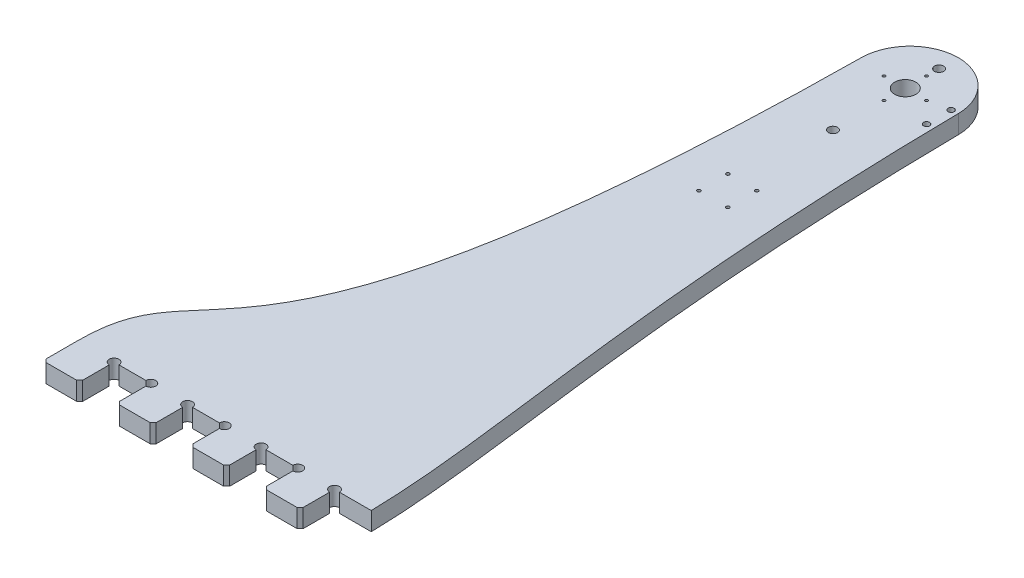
ISO-10303-21;
HEADER;
FILE_DESCRIPTION(('STEP AP214'),'2;1');
FILE_NAME('part.step','',(''),(''),'','','');
FILE_SCHEMA(('AUTOMOTIVE_DESIGN { 1 0 10303 214 1 1 1 1 }'));
ENDSEC;
DATA;
#1=APPLICATION_CONTEXT('core data for automotive mechanical design processes');
#2=APPLICATION_PROTOCOL_DEFINITION('international standard','automotive_design',2000,#1);
#3=PRODUCT_CONTEXT('',#1,'mechanical');
#4=PRODUCT('Part','Part','',(#3));
#5=PRODUCT_RELATED_PRODUCT_CATEGORY('part','',(#4));
#6=PRODUCT_DEFINITION_FORMATION('','',#4);
#7=PRODUCT_DEFINITION_CONTEXT('part definition',#1,'design');
#8=PRODUCT_DEFINITION('design','',#6,#7);
#9=PRODUCT_DEFINITION_SHAPE('','',#8);
#10=(LENGTH_UNIT() NAMED_UNIT(*) SI_UNIT(.MILLI.,.METRE.));
#11=(NAMED_UNIT(*) PLANE_ANGLE_UNIT() SI_UNIT($,.RADIAN.));
#12=(NAMED_UNIT(*) SI_UNIT($,.STERADIAN.) SOLID_ANGLE_UNIT());
#13=UNCERTAINTY_MEASURE_WITH_UNIT(LENGTH_MEASURE(1.E-05),#10,'distance_accuracy_value','');
#14=(GEOMETRIC_REPRESENTATION_CONTEXT(3) GLOBAL_UNCERTAINTY_ASSIGNED_CONTEXT((#13)) GLOBAL_UNIT_ASSIGNED_CONTEXT((#10,
#11,#12)) REPRESENTATION_CONTEXT('',''));
#15=CARTESIAN_POINT('',(0.,0.,0.));
#16=DIRECTION('',(0.,0.,1.));
#17=DIRECTION('',(1.,0.,0.));
#18=AXIS2_PLACEMENT_3D('',#15,#16,#17);
#19=CARTESIAN_POINT('',(0.,19.05,0.));
#20=DIRECTION('',(0.,0.,-1.));
#21=DIRECTION('',(-1.,0.,0.));
#22=AXIS2_PLACEMENT_3D('',#19,#20,#21);
#23=PLANE('',#22);
#24=DIRECTION('',(1.,0.,0.));
#25=VECTOR('',#24,1.);
#26=CARTESIAN_POINT('',(0.,19.05,0.));
#27=LINE('',#26,#25);
#28=CARTESIAN_POINT('',(195.58,19.05,0.));
#29=VERTEX_POINT('',#28);
#30=CARTESIAN_POINT('',(223.52,19.05,0.));
#31=VERTEX_POINT('',#30);
#32=EDGE_CURVE('E551',#29,#31,#27,.T.);
#33=ORIENTED_EDGE('',*,*,#32,.F.);
#34=DIRECTION('',(0.,1.,0.));
#35=VECTOR('',#34,1.);
#36=CARTESIAN_POINT('',(195.58,-0.001000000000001,0.));
#37=LINE('',#36,#35);
#38=CARTESIAN_POINT('',(195.58,0.,0.));
#39=VERTEX_POINT('',#38);
#40=EDGE_CURVE('E519',#39,#29,#37,.T.);
#41=ORIENTED_EDGE('',*,*,#40,.F.);
#42=DIRECTION('',(1.,0.,0.));
#43=VECTOR('',#42,1.);
#44=CARTESIAN_POINT('',(0.,0.,0.));
#45=LINE('',#44,#43);
#46=CARTESIAN_POINT('',(223.52,0.,0.));
#47=VERTEX_POINT('',#46);
#48=EDGE_CURVE('E295',#39,#47,#45,.T.);
#49=ORIENTED_EDGE('',*,*,#48,.T.);
#50=DIRECTION('',(0.,1.,0.));
#51=VECTOR('',#50,1.);
#52=CARTESIAN_POINT('',(223.52,-0.001000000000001,0.));
#53=LINE('',#52,#51);
#54=EDGE_CURVE('E510',#31,#47,#53,.F.);
#55=ORIENTED_EDGE('',*,*,#54,.F.);
#56=EDGE_LOOP('',(#33,#41,#49,#55));
#57=FACE_BOUND('',#56,.T.);
#58=ADVANCED_FACE('F33',(#57),#23,.F.);
#59=CARTESIAN_POINT('',(119.38,19.05,0.));
#60=VERTEX_POINT('',#59);
#61=CARTESIAN_POINT('',(147.32,19.05,0.));
#62=VERTEX_POINT('',#61);
#63=EDGE_CURVE('E550',#60,#62,#27,.T.);
#64=ORIENTED_EDGE('',*,*,#63,.F.);
#65=DIRECTION('',(0.,1.,0.));
#66=VECTOR('',#65,1.);
#67=CARTESIAN_POINT('',(119.38,-0.001000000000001,0.));
#68=LINE('',#67,#66);
#69=CARTESIAN_POINT('',(119.38,0.,0.));
#70=VERTEX_POINT('',#69);
#71=EDGE_CURVE('E536',#70,#60,#68,.T.);
#72=ORIENTED_EDGE('',*,*,#71,.F.);
#73=CARTESIAN_POINT('',(147.32,0.,0.));
#74=VERTEX_POINT('',#73);
#75=EDGE_CURVE('E289',#70,#74,#45,.T.);
#76=ORIENTED_EDGE('',*,*,#75,.T.);
#77=DIRECTION('',(0.,1.,0.));
#78=VECTOR('',#77,1.);
#79=CARTESIAN_POINT('',(147.32,-0.001000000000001,0.));
#80=LINE('',#79,#78);
#81=EDGE_CURVE('E528',#62,#74,#80,.F.);
#82=ORIENTED_EDGE('',*,*,#81,.F.);
#83=EDGE_LOOP('',(#64,#72,#76,#82));
#84=FACE_BOUND('',#83,.T.);
#85=ADVANCED_FACE('F694',(#84),#23,.F.);
#86=CARTESIAN_POINT('',(43.18,0.,0.));
#87=VERTEX_POINT('',#86);
#88=CARTESIAN_POINT('',(71.12,0.,0.));
#89=VERTEX_POINT('',#88);
#90=EDGE_CURVE('E280',#87,#89,#45,.T.);
#91=ORIENTED_EDGE('',*,*,#90,.T.);
#92=DIRECTION('',(0.,1.,0.));
#93=VECTOR('',#92,1.);
#94=CARTESIAN_POINT('',(71.12,-0.001000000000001,0.));
#95=LINE('',#94,#93);
#96=CARTESIAN_POINT('',(71.12,19.05,0.));
#97=VERTEX_POINT('',#96);
#98=EDGE_CURVE('E260',#97,#89,#95,.F.);
#99=ORIENTED_EDGE('',*,*,#98,.F.);
#100=CARTESIAN_POINT('',(43.18,19.05,0.));
#101=VERTEX_POINT('',#100);
#102=EDGE_CURVE('E324',#101,#97,#27,.T.);
#103=ORIENTED_EDGE('',*,*,#102,.F.);
#104=DIRECTION('',(0.,1.,0.));
#105=VECTOR('',#104,1.);
#106=CARTESIAN_POINT('',(43.18,-0.001000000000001,0.));
#107=LINE('',#106,#105);
#108=EDGE_CURVE('E287',#87,#101,#107,.T.);
#109=ORIENTED_EDGE('',*,*,#108,.F.);
#110=EDGE_LOOP('',(#91,#99,#103,#109));
#111=FACE_BOUND('',#110,.T.);
#112=ADVANCED_FACE('F286',(#111),#23,.F.);
#113=CARTESIAN_POINT('',(76.0861935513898,19.05,-146.943089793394));
#114=DIRECTION('',(0.,1.,0.));
#115=DIRECTION('',(0.,0.,1.));
#116=AXIS2_PLACEMENT_3D('',#113,#114,#115);
#117=PLANE('',#116);
#118=CARTESIAN_POINT('',(201.888007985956,19.05,-660.4));
#119=DIRECTION('',(0.,1.,0.));
#120=DIRECTION('',(0.,0.,1.));
#121=AXIS2_PLACEMENT_3D('',#118,#119,#120);
#122=CIRCLE('',#121,50.8);
#123=CARTESIAN_POINT('',(252.68467659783,19.05,-660.981771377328));
#124=VERTEX_POINT('',#123);
#125=CARTESIAN_POINT('',(202.409881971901,19.05,-711.197319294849));
#126=VERTEX_POINT('',#125);
#127=EDGE_CURVE('E49',#124,#126,#122,.T.);
#128=ORIENTED_EDGE('',*,*,#127,.T.);
#129=CARTESIAN_POINT('',(202.931755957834,19.05,-660.4));
#130=DIRECTION('',(0.,1.,0.));
#131=DIRECTION('',(0.,0.,1.));
#132=AXIS2_PLACEMENT_3D('',#129,#130,#131);
#133=CIRCLE('',#132,50.8);
#134=CARTESIAN_POINT('',(152.134714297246,19.05,-660.948232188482));
#135=VERTEX_POINT('',#134);
#136=EDGE_CURVE('E42',#126,#135,#133,.T.);
#137=ORIENTED_EDGE('',*,*,#136,.T.);
#138=CARTESIAN_POINT('',(152.4,19.05,-711.2));
#139=CARTESIAN_POINT('',(152.4,19.05,0.));
#140=CARTESIAN_POINT('',(-0.30348386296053,19.05,-154.781572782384));
#141=CARTESIAN_POINT('',(0.,19.05,0.));
#142=B_SPLINE_CURVE_WITH_KNOTS('',3,(#138,#139,#140,#141),.UNSPECIFIED.,.F.,.F.,(4,4),(0.,1.),.UNSPECIFIED.);
#143=CARTESIAN_POINT('',(0.,19.05,0.));
#144=VERTEX_POINT('',#143);
#145=EDGE_CURVE('E292',#135,#144,#142,.T.);
#146=ORIENTED_EDGE('',*,*,#145,.T.);
#147=DIRECTION('',(0.,0.,1.));
#148=VECTOR('',#147,1.);
#149=CARTESIAN_POINT('',(0.,19.05,0.));
#150=LINE('',#149,#148);
#151=CARTESIAN_POINT('',(0.,19.05,32.5250000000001));
#152=VERTEX_POINT('',#151);
#153=EDGE_CURVE('E437',#144,#152,#150,.T.);
#154=ORIENTED_EDGE('',*,*,#153,.T.);
#155=DIRECTION('',(-0.707106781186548,0.,-0.707106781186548));
#156=VECTOR('',#155,1.);
#157=CARTESIAN_POINT('',(-51.6909481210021,19.05,-19.165948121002));
#158=LINE('',#157,#156);
#159=CARTESIAN_POINT('',(3.17499999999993,19.05,35.7));
#160=VERTEX_POINT('',#159);
#161=EDGE_CURVE('E640',#152,#160,#158,.F.);
#162=ORIENTED_EDGE('',*,*,#161,.T.);
#163=DIRECTION('',(1.,0.,0.));
#164=VECTOR('',#163,1.);
#165=CARTESIAN_POINT('',(0.,19.05,35.7));
#166=LINE('',#165,#164);
#167=CARTESIAN_POINT('',(34.9250000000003,19.05,35.7));
#168=VERTEX_POINT('',#167);
#169=EDGE_CURVE('E434',#160,#168,#166,.T.);
#170=ORIENTED_EDGE('',*,*,#169,.T.);
#171=DIRECTION('',(-0.707106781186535,0.,0.70710678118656));
#172=VECTOR('',#171,1.);
#173=CARTESIAN_POINT('',(146.827141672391,19.05,-76.2021416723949));
#174=LINE('',#173,#172);
#175=CARTESIAN_POINT('',(38.1,19.05,32.5250000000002));
#176=VERTEX_POINT('',#175);
#177=EDGE_CURVE('E638',#168,#176,#174,.F.);
#178=ORIENTED_EDGE('',*,*,#177,.T.);
#179=DIRECTION('',(0.,0.,-1.));
#180=VECTOR('',#179,1.);
#181=CARTESIAN_POINT('',(38.1,19.05,0.));
#182=LINE('',#181,#180);
#183=CARTESIAN_POINT('',(38.1,19.05,5.08));
#184=VERTEX_POINT('',#183);
#185=EDGE_CURVE('E430',#176,#184,#182,.T.);
#186=ORIENTED_EDGE('',*,*,#185,.T.);
#187=CARTESIAN_POINT('',(38.1,19.05,0.));
#188=DIRECTION('',(0.,1.,0.));
#189=DIRECTION('',(0.,0.,1.));
#190=AXIS2_PLACEMENT_3D('',#187,#188,#189);
#191=CIRCLE('',#190,5.08);
#192=EDGE_CURVE('E490',#101,#184,#191,.T.);
#193=ORIENTED_EDGE('',*,*,#192,.F.);
#194=ORIENTED_EDGE('',*,*,#102,.T.);
#195=CARTESIAN_POINT('',(76.2,19.05,0.));
#196=DIRECTION('',(0.,1.,0.));
#197=DIRECTION('',(0.,0.,1.));
#198=AXIS2_PLACEMENT_3D('',#195,#196,#197);
#199=CIRCLE('',#198,5.08);
#200=CARTESIAN_POINT('',(76.2,19.05,5.08));
#201=VERTEX_POINT('',#200);
#202=EDGE_CURVE('E266',#201,#97,#199,.T.);
#203=ORIENTED_EDGE('',*,*,#202,.F.);
#204=DIRECTION('',(0.,0.,1.));
#205=VECTOR('',#204,1.);
#206=CARTESIAN_POINT('',(76.2,19.05,0.));
#207=LINE('',#206,#205);
#208=CARTESIAN_POINT('',(76.2,19.05,32.5250000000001));
#209=VERTEX_POINT('',#208);
#210=EDGE_CURVE('E452',#201,#209,#207,.T.);
#211=ORIENTED_EDGE('',*,*,#210,.T.);
#212=DIRECTION('',(-0.707106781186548,0.,-0.707106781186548));
#213=VECTOR('',#212,1.);
#214=CARTESIAN_POINT('',(-13.5909481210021,19.05,-57.265948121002));
#215=LINE('',#214,#213);
#216=CARTESIAN_POINT('',(79.3749999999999,19.05,35.7));
#217=VERTEX_POINT('',#216);
#218=EDGE_CURVE('E636',#209,#217,#215,.F.);
#219=ORIENTED_EDGE('',*,*,#218,.T.);
#220=DIRECTION('',(1.,0.,0.));
#221=VECTOR('',#220,1.);
#222=CARTESIAN_POINT('',(76.2,19.05,35.7));
#223=LINE('',#222,#221);
#224=CARTESIAN_POINT('',(111.125,19.05,35.7));
#225=VERTEX_POINT('',#224);
#226=EDGE_CURVE('E449',#217,#225,#223,.T.);
#227=ORIENTED_EDGE('',*,*,#226,.T.);
#228=DIRECTION('',(-0.707106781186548,0.,0.707106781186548));
#229=VECTOR('',#228,1.);
#230=CARTESIAN_POINT('',(184.927141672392,19.05,-38.1021416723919));
#231=LINE('',#230,#229);
#232=CARTESIAN_POINT('',(114.3,19.05,32.5249999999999));
#233=VERTEX_POINT('',#232);
#234=EDGE_CURVE('E634',#225,#233,#231,.F.);
#235=ORIENTED_EDGE('',*,*,#234,.T.);
#236=DIRECTION('',(0.,0.,-1.));
#237=VECTOR('',#236,1.);
#238=CARTESIAN_POINT('',(114.3,19.05,0.));
#239=LINE('',#238,#237);
#240=CARTESIAN_POINT('',(114.3,19.05,5.07999999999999));
#241=VERTEX_POINT('',#240);
#242=EDGE_CURVE('E445',#233,#241,#239,.T.);
#243=ORIENTED_EDGE('',*,*,#242,.T.);
#244=CARTESIAN_POINT('',(114.3,19.05,0.));
#245=DIRECTION('',(0.,1.,0.));
#246=DIRECTION('',(0.,0.,1.));
#247=AXIS2_PLACEMENT_3D('',#244,#245,#246);
#248=CIRCLE('',#247,5.07999999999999);
#249=EDGE_CURVE('E534',#60,#241,#248,.T.);
#250=ORIENTED_EDGE('',*,*,#249,.F.);
#251=ORIENTED_EDGE('',*,*,#63,.T.);
#252=CARTESIAN_POINT('',(152.4,19.05,0.));
#253=DIRECTION('',(0.,1.,0.));
#254=DIRECTION('',(0.,0.,1.));
#255=AXIS2_PLACEMENT_3D('',#252,#253,#254);
#256=CIRCLE('',#255,5.07999999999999);
#257=CARTESIAN_POINT('',(152.4,19.05,5.07999999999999));
#258=VERTEX_POINT('',#257);
#259=EDGE_CURVE('E526',#258,#62,#256,.T.);
#260=ORIENTED_EDGE('',*,*,#259,.F.);
#261=DIRECTION('',(0.,0.,1.));
#262=VECTOR('',#261,1.);
#263=CARTESIAN_POINT('',(152.4,19.05,0.));
#264=LINE('',#263,#262);
#265=CARTESIAN_POINT('',(152.4,19.05,32.5249999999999));
#266=VERTEX_POINT('',#265);
#267=EDGE_CURVE('E467',#258,#266,#264,.T.);
#268=ORIENTED_EDGE('',*,*,#267,.T.);
#269=DIRECTION('',(-0.707106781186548,0.,-0.707106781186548));
#270=VECTOR('',#269,1.);
#271=CARTESIAN_POINT('',(24.509051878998,19.05,-95.365948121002));
#272=LINE('',#271,#270);
#273=CARTESIAN_POINT('',(155.575,19.05,35.7));
#274=VERTEX_POINT('',#273);
#275=EDGE_CURVE('E632',#266,#274,#272,.F.);
#276=ORIENTED_EDGE('',*,*,#275,.T.);
#277=DIRECTION('',(1.,0.,0.));
#278=VECTOR('',#277,1.);
#279=CARTESIAN_POINT('',(152.4,19.05,35.7));
#280=LINE('',#279,#278);
#281=CARTESIAN_POINT('',(187.325,19.05,35.7));
#282=VERTEX_POINT('',#281);
#283=EDGE_CURVE('E464',#274,#282,#280,.T.);
#284=ORIENTED_EDGE('',*,*,#283,.T.);
#285=DIRECTION('',(-0.707106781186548,0.,0.707106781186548));
#286=VECTOR('',#285,1.);
#287=CARTESIAN_POINT('',(223.027141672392,19.05,-0.00214167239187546));
#288=LINE('',#287,#286);
#289=CARTESIAN_POINT('',(190.5,19.05,32.5249999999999));
#290=VERTEX_POINT('',#289);
#291=EDGE_CURVE('E630',#282,#290,#288,.F.);
#292=ORIENTED_EDGE('',*,*,#291,.T.);
#293=DIRECTION('',(0.,0.,-1.));
#294=VECTOR('',#293,1.);
#295=CARTESIAN_POINT('',(190.5,19.05,0.));
#296=LINE('',#295,#294);
#297=CARTESIAN_POINT('',(190.5,19.05,5.08000000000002));
#298=VERTEX_POINT('',#297);
#299=EDGE_CURVE('E460',#290,#298,#296,.T.);
#300=ORIENTED_EDGE('',*,*,#299,.T.);
#301=CARTESIAN_POINT('',(190.5,19.05,0.));
#302=DIRECTION('',(0.,1.,0.));
#303=DIRECTION('',(0.,0.,1.));
#304=AXIS2_PLACEMENT_3D('',#301,#302,#303);
#305=CIRCLE('',#304,5.08000000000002);
#306=EDGE_CURVE('E517',#29,#298,#305,.T.);
#307=ORIENTED_EDGE('',*,*,#306,.F.);
#308=ORIENTED_EDGE('',*,*,#32,.T.);
#309=CARTESIAN_POINT('',(228.6,19.05,0.));
#310=DIRECTION('',(0.,1.,0.));
#311=DIRECTION('',(0.,0.,1.));
#312=AXIS2_PLACEMENT_3D('',#309,#310,#311);
#313=CIRCLE('',#312,5.07999999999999);
#314=CARTESIAN_POINT('',(228.6,19.05,5.07999999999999));
#315=VERTEX_POINT('',#314);
#316=EDGE_CURVE('E508',#315,#31,#313,.T.);
#317=ORIENTED_EDGE('',*,*,#316,.F.);
#318=DIRECTION('',(0.,0.,1.));
#319=VECTOR('',#318,1.);
#320=CARTESIAN_POINT('',(228.6,19.05,0.));
#321=LINE('',#320,#319);
#322=CARTESIAN_POINT('',(228.6,19.05,32.5250000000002));
#323=VERTEX_POINT('',#322);
#324=EDGE_CURVE('E483',#315,#323,#321,.T.);
#325=ORIENTED_EDGE('',*,*,#324,.T.);
#326=DIRECTION('',(-0.70710678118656,0.,-0.707106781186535));
#327=VECTOR('',#326,1.);
#328=CARTESIAN_POINT('',(62.6090518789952,19.05,-133.465948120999));
#329=LINE('',#328,#327);
#330=CARTESIAN_POINT('',(231.775,19.05,35.7));
#331=VERTEX_POINT('',#330);
#332=EDGE_CURVE('E628',#323,#331,#329,.F.);
#333=ORIENTED_EDGE('',*,*,#332,.T.);
#334=DIRECTION('',(1.,0.,0.));
#335=VECTOR('',#334,1.);
#336=CARTESIAN_POINT('',(228.6,19.05,35.7));
#337=LINE('',#336,#335);
#338=CARTESIAN_POINT('',(263.525,19.05,35.7));
#339=VERTEX_POINT('',#338);
#340=EDGE_CURVE('E480',#331,#339,#337,.T.);
#341=ORIENTED_EDGE('',*,*,#340,.T.);
#342=DIRECTION('',(-0.70710678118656,0.,0.707106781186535));
#343=VECTOR('',#342,1.);
#344=CARTESIAN_POINT('',(261.127141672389,19.05,38.0978583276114));
#345=LINE('',#344,#343);
#346=CARTESIAN_POINT('',(266.7,19.05,32.5250000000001));
#347=VERTEX_POINT('',#346);
#348=EDGE_CURVE('E626',#339,#347,#345,.F.);
#349=ORIENTED_EDGE('',*,*,#348,.T.);
#350=DIRECTION('',(0.,0.,-1.));
#351=VECTOR('',#350,1.);
#352=CARTESIAN_POINT('',(266.7,19.05,0.));
#353=LINE('',#352,#351);
#354=CARTESIAN_POINT('',(266.7,19.05,5.07999999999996));
#355=VERTEX_POINT('',#354);
#356=EDGE_CURVE('E476',#347,#355,#353,.T.);
#357=ORIENTED_EDGE('',*,*,#356,.T.);
#358=CARTESIAN_POINT('',(266.7,19.05,0.));
#359=DIRECTION('',(0.,1.,0.));
#360=DIRECTION('',(0.,0.,1.));
#361=AXIS2_PLACEMENT_3D('',#358,#359,#360);
#362=CIRCLE('',#361,5.07999999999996);
#363=CARTESIAN_POINT('',(271.78,19.05,0.));
#364=VERTEX_POINT('',#363);
#365=EDGE_CURVE('E498',#364,#355,#362,.T.);
#366=ORIENTED_EDGE('',*,*,#365,.F.);
#367=CARTESIAN_POINT('',(304.8,19.05,0.));
#368=VERTEX_POINT('',#367);
#369=EDGE_CURVE('E348',#364,#368,#27,.T.);
#370=ORIENTED_EDGE('',*,*,#369,.T.);
#371=CARTESIAN_POINT('',(304.8,19.05,0.));
#372=CARTESIAN_POINT('',(301.724749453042,19.05,-149.320453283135));
#373=CARTESIAN_POINT('',(252.3998,19.05,-326.056475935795));
#374=CARTESIAN_POINT('',(252.3998,19.05,-711.2));
#375=B_SPLINE_CURVE_WITH_KNOTS('',3,(#371,#372,#373,#374),.UNSPECIFIED.,.F.,.F.,(4,4),(0.,1.),.UNSPECIFIED.);
#376=EDGE_CURVE('E315',#368,#124,#375,.T.);
#377=ORIENTED_EDGE('',*,*,#376,.T.);
#378=EDGE_LOOP('',(#128,#137,#146,#154,#162,#170,#178,#186,#193,#194,#203,#211,#219,#227,#235,
#243,#250,#251,#260,#268,#276,#284,#292,#300,#307,#308,#317,#325,#333,#341,#349,#357,#366,#370,#377));
#379=FACE_BOUND('',#378,.T.);
#380=CARTESIAN_POINT('',(217.3999,19.05,-487.2));
#381=DIRECTION('',(0.,1.,0.));
#382=DIRECTION('',(0.,0.,1.));
#383=AXIS2_PLACEMENT_3D('',#380,#381,#382);
#384=CIRCLE('',#383,1.75000000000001);
#385=CARTESIAN_POINT('',(217.3999,19.05,-488.95));
#386=VERTEX_POINT('',#385);
#387=EDGE_CURVE('E412',#386,#386,#384,.T.);
#388=ORIENTED_EDGE('',*,*,#387,.F.);
#389=EDGE_LOOP('',(#388));
#390=FACE_BOUND('',#389,.T.);
#391=CARTESIAN_POINT('',(245.668575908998,19.05,-635.));
#392=DIRECTION('',(0.,1.,0.));
#393=DIRECTION('',(0.,0.,1.));
#394=AXIS2_PLACEMENT_3D('',#391,#392,#393);
#395=CIRCLE('',#394,3.175);
#396=CARTESIAN_POINT('',(245.668575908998,19.05,-638.175));
#397=VERTEX_POINT('',#396);
#398=EDGE_CURVE('E400',#397,#397,#395,.T.);
#399=ORIENTED_EDGE('',*,*,#398,.F.);
#400=EDGE_LOOP('',(#399));
#401=FACE_BOUND('',#400,.T.);
#402=CARTESIAN_POINT('',(202.399900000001,19.05,-634.2));
#403=DIRECTION('',(0.,1.,0.));
#404=DIRECTION('',(0.,0.,1.));
#405=AXIS2_PLACEMENT_3D('',#402,#403,#404);
#406=CIRCLE('',#405,1.49999999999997);
#407=CARTESIAN_POINT('',(202.399900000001,19.05,-635.7));
#408=VERTEX_POINT('',#407);
#409=EDGE_CURVE('E388',#408,#408,#406,.T.);
#410=ORIENTED_EDGE('',*,*,#409,.F.);
#411=EDGE_LOOP('',(#410));
#412=FACE_BOUND('',#411,.T.);
#413=CARTESIAN_POINT('',(187.3999,19.05,-457.2));
#414=DIRECTION('',(0.,1.,0.));
#415=DIRECTION('',(0.,0.,1.));
#416=AXIS2_PLACEMENT_3D('',#413,#414,#415);
#417=CIRCLE('',#416,1.75000000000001);
#418=CARTESIAN_POINT('',(187.3999,19.05,-458.95));
#419=VERTEX_POINT('',#418);
#420=EDGE_CURVE('E376',#419,#419,#417,.T.);
#421=ORIENTED_EDGE('',*,*,#420,.F.);
#422=EDGE_LOOP('',(#421));
#423=FACE_BOUND('',#422,.T.);
#424=CARTESIAN_POINT('',(202.3999,19.05,-678.2));
#425=DIRECTION('',(0.,1.,0.));
#426=DIRECTION('',(0.,0.,1.));
#427=AXIS2_PLACEMENT_3D('',#424,#425,#426);
#428=CIRCLE('',#427,1.5);
#429=CARTESIAN_POINT('',(202.3999,19.05,-679.7));
#430=VERTEX_POINT('',#429);
#431=EDGE_CURVE('E364',#430,#430,#428,.T.);
#432=ORIENTED_EDGE('',*,*,#431,.F.);
#433=EDGE_LOOP('',(#432));
#434=FACE_BOUND('',#433,.T.);
#435=CARTESIAN_POINT('',(202.399900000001,19.05,-581.2));
#436=DIRECTION('',(0.,1.,0.));
#437=DIRECTION('',(0.,0.,1.));
#438=AXIS2_PLACEMENT_3D('',#435,#436,#437);
#439=CIRCLE('',#438,4.76250000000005);
#440=CARTESIAN_POINT('',(202.399900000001,19.05,-585.9625));
#441=VERTEX_POINT('',#440);
#442=EDGE_CURVE('E353',#441,#441,#439,.T.);
#443=ORIENTED_EDGE('',*,*,#442,.F.);
#444=EDGE_LOOP('',(#443));
#445=FACE_BOUND('',#444,.T.);
#446=CARTESIAN_POINT('',(202.3999,19.05,-691.2));
#447=DIRECTION('',(0.,1.,0.));
#448=DIRECTION('',(0.,0.,1.));
#449=AXIS2_PLACEMENT_3D('',#446,#447,#448);
#450=CIRCLE('',#449,4.76250000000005);
#451=CARTESIAN_POINT('',(202.3999,19.05,-695.9625));
#452=VERTEX_POINT('',#451);
#453=EDGE_CURVE('E304',#452,#452,#450,.T.);
#454=ORIENTED_EDGE('',*,*,#453,.F.);
#455=EDGE_LOOP('',(#454));
#456=FACE_BOUND('',#455,.T.);
#457=CARTESIAN_POINT('',(202.3999,19.05,-656.2));
#458=DIRECTION('',(0.,1.,0.));
#459=DIRECTION('',(0.,0.,1.));
#460=AXIS2_PLACEMENT_3D('',#457,#458,#459);
#461=CIRCLE('',#460,11.);
#462=CARTESIAN_POINT('',(202.3999,19.05,-667.2));
#463=VERTEX_POINT('',#462);
#464=EDGE_CURVE('E358',#463,#463,#461,.T.);
#465=ORIENTED_EDGE('',*,*,#464,.F.);
#466=EDGE_LOOP('',(#465));
#467=FACE_BOUND('',#466,.T.);
#468=CARTESIAN_POINT('',(245.668575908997,19.05,-660.4));
#469=DIRECTION('',(0.,1.,0.));
#470=DIRECTION('',(0.,0.,1.));
#471=AXIS2_PLACEMENT_3D('',#468,#469,#470);
#472=CIRCLE('',#471,3.175);
#473=CARTESIAN_POINT('',(245.668575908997,19.05,-663.575));
#474=VERTEX_POINT('',#473);
#475=EDGE_CURVE('E370',#474,#474,#472,.T.);
#476=ORIENTED_EDGE('',*,*,#475,.F.);
#477=EDGE_LOOP('',(#476));
#478=FACE_BOUND('',#477,.T.);
#479=CARTESIAN_POINT('',(224.3999,19.05,-656.2));
#480=DIRECTION('',(0.,1.,0.));
#481=DIRECTION('',(0.,0.,1.));
#482=AXIS2_PLACEMENT_3D('',#479,#480,#481);
#483=CIRCLE('',#482,1.50000000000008);
#484=CARTESIAN_POINT('',(224.3999,19.05,-657.7));
#485=VERTEX_POINT('',#484);
#486=EDGE_CURVE('E382',#485,#485,#483,.T.);
#487=ORIENTED_EDGE('',*,*,#486,.F.);
#488=EDGE_LOOP('',(#487));
#489=FACE_BOUND('',#488,.T.);
#490=CARTESIAN_POINT('',(180.3999,19.05,-656.199999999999));
#491=DIRECTION('',(0.,1.,0.));
#492=DIRECTION('',(0.,0.,1.));
#493=AXIS2_PLACEMENT_3D('',#490,#491,#492);
#494=CIRCLE('',#493,1.49999999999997);
#495=CARTESIAN_POINT('',(180.3999,19.05,-657.699999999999));
#496=VERTEX_POINT('',#495);
#497=EDGE_CURVE('E394',#496,#496,#494,.T.);
#498=ORIENTED_EDGE('',*,*,#497,.F.);
#499=EDGE_LOOP('',(#498));
#500=FACE_BOUND('',#499,.T.);
#501=CARTESIAN_POINT('',(217.3999,19.05,-457.2));
#502=DIRECTION('',(0.,1.,0.));
#503=DIRECTION('',(0.,0.,1.));
#504=AXIS2_PLACEMENT_3D('',#501,#502,#503);
#505=CIRCLE('',#504,1.75000000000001);
#506=CARTESIAN_POINT('',(217.3999,19.05,-458.95));
#507=VERTEX_POINT('',#506);
#508=EDGE_CURVE('E406',#507,#507,#505,.T.);
#509=ORIENTED_EDGE('',*,*,#508,.F.);
#510=EDGE_LOOP('',(#509));
#511=FACE_BOUND('',#510,.T.);
#512=CARTESIAN_POINT('',(187.3999,19.05,-487.2));
#513=DIRECTION('',(0.,1.,0.));
#514=DIRECTION('',(0.,0.,1.));
#515=AXIS2_PLACEMENT_3D('',#512,#513,#514);
#516=CIRCLE('',#515,1.75000000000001);
#517=CARTESIAN_POINT('',(187.3999,19.05,-488.95));
#518=VERTEX_POINT('',#517);
#519=EDGE_CURVE('E418',#518,#518,#516,.T.);
#520=ORIENTED_EDGE('',*,*,#519,.F.);
#521=EDGE_LOOP('',(#520));
#522=FACE_BOUND('',#521,.T.);
#523=ADVANCED_FACE('F546',(#379,#390,#401,#412,#423,#434,#445,#456,#467,#478,#489,#500,#511,
#522),#117,.T.);
#524=CARTESIAN_POINT('',(76.0861935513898,0.,-146.943089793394));
#525=DIRECTION('',(0.,1.,0.));
#526=DIRECTION('',(0.,0.,1.));
#527=AXIS2_PLACEMENT_3D('',#524,#525,#526);
#528=PLANE('',#527);
#529=CARTESIAN_POINT('',(152.4,0.,-711.2));
#530=CARTESIAN_POINT('',(152.4,0.,0.));
#531=CARTESIAN_POINT('',(-0.30348386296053,0.,-154.781572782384));
#532=CARTESIAN_POINT('',(0.,0.,0.));
#533=B_SPLINE_CURVE_WITH_KNOTS('',3,(#529,#530,#531,#532),.UNSPECIFIED.,.F.,.F.,(4,4),(0.,1.),.UNSPECIFIED.);
#534=CARTESIAN_POINT('',(152.134714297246,0.,-660.948232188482));
#535=VERTEX_POINT('',#534);
#536=CARTESIAN_POINT('',(0.,0.,0.));
#537=VERTEX_POINT('',#536);
#538=EDGE_CURVE('E297',#535,#537,#533,.T.);
#539=ORIENTED_EDGE('',*,*,#538,.F.);
#540=CARTESIAN_POINT('',(202.931755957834,0.,-660.4));
#541=DIRECTION('',(0.,1.,0.));
#542=DIRECTION('',(0.,0.,1.));
#543=AXIS2_PLACEMENT_3D('',#540,#541,#542);
#544=CIRCLE('',#543,50.8);
#545=CARTESIAN_POINT('',(202.409881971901,0.,-711.197319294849));
#546=VERTEX_POINT('',#545);
#547=EDGE_CURVE('E564',#535,#546,#544,.F.);
#548=ORIENTED_EDGE('',*,*,#547,.T.);
#549=CARTESIAN_POINT('',(201.888007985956,0.,-660.4));
#550=DIRECTION('',(0.,1.,0.));
#551=DIRECTION('',(0.,0.,1.));
#552=AXIS2_PLACEMENT_3D('',#549,#550,#551);
#553=CIRCLE('',#552,50.8);
#554=CARTESIAN_POINT('',(252.68467659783,0.,-660.981771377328));
#555=VERTEX_POINT('',#554);
#556=EDGE_CURVE('E561',#546,#555,#553,.F.);
#557=ORIENTED_EDGE('',*,*,#556,.T.);
#558=CARTESIAN_POINT('',(304.8,0.,0.));
#559=CARTESIAN_POINT('',(301.724749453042,0.,-149.320453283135));
#560=CARTESIAN_POINT('',(252.3998,0.,-326.056475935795));
#561=CARTESIAN_POINT('',(252.3998,0.,-711.2));
#562=B_SPLINE_CURVE_WITH_KNOTS('',3,(#558,#559,#560,#561),.UNSPECIFIED.,.F.,.F.,(4,4),(0.,1.),.UNSPECIFIED.);
#563=CARTESIAN_POINT('',(304.8,0.,0.));
#564=VERTEX_POINT('',#563);
#565=EDGE_CURVE('E288',#564,#555,#562,.T.);
#566=ORIENTED_EDGE('',*,*,#565,.F.);
#567=CARTESIAN_POINT('',(271.78,0.,0.));
#568=VERTEX_POINT('',#567);
#569=EDGE_CURVE('E291',#568,#564,#45,.T.);
#570=ORIENTED_EDGE('',*,*,#569,.F.);
#571=CARTESIAN_POINT('',(266.7,0.,0.));
#572=DIRECTION('',(0.,1.,0.));
#573=DIRECTION('',(0.,0.,1.));
#574=AXIS2_PLACEMENT_3D('',#571,#572,#573);
#575=CIRCLE('',#574,5.07999999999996);
#576=CARTESIAN_POINT('',(266.7,0.,5.07999999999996));
#577=VERTEX_POINT('',#576);
#578=EDGE_CURVE('E495',#577,#568,#575,.F.);
#579=ORIENTED_EDGE('',*,*,#578,.F.);
#580=DIRECTION('',(0.,0.,1.));
#581=VECTOR('',#580,1.);
#582=CARTESIAN_POINT('',(266.7,0.,0.));
#583=LINE('',#582,#581);
#584=CARTESIAN_POINT('',(266.7,0.,32.5250000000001));
#585=VERTEX_POINT('',#584);
#586=EDGE_CURVE('E479',#577,#585,#583,.T.);
#587=ORIENTED_EDGE('',*,*,#586,.T.);
#588=DIRECTION('',(0.70710678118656,0.,-0.707106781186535));
#589=VECTOR('',#588,1.);
#590=CARTESIAN_POINT('',(263.525,0.,35.7));
#591=LINE('',#590,#589);
#592=CARTESIAN_POINT('',(263.525,0.,35.7));
#593=VERTEX_POINT('',#592);
#594=EDGE_CURVE('E607',#585,#593,#591,.F.);
#595=ORIENTED_EDGE('',*,*,#594,.T.);
#596=DIRECTION('',(-1.,0.,0.));
#597=VECTOR('',#596,1.);
#598=CARTESIAN_POINT('',(228.6,0.,35.7));
#599=LINE('',#598,#597);
#600=CARTESIAN_POINT('',(231.775,0.,35.7));
#601=VERTEX_POINT('',#600);
#602=EDGE_CURVE('E469',#593,#601,#599,.T.);
#603=ORIENTED_EDGE('',*,*,#602,.T.);
#604=DIRECTION('',(0.70710678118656,0.,0.707106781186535));
#605=VECTOR('',#604,1.);
#606=CARTESIAN_POINT('',(228.6,0.,32.5250000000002));
#607=LINE('',#606,#605);
#608=CARTESIAN_POINT('',(228.6,0.,32.5250000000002));
#609=VERTEX_POINT('',#608);
#610=EDGE_CURVE('E609',#601,#609,#607,.F.);
#611=ORIENTED_EDGE('',*,*,#610,.T.);
#612=DIRECTION('',(0.,0.,-1.));
#613=VECTOR('',#612,1.);
#614=CARTESIAN_POINT('',(228.6,0.,0.));
#615=LINE('',#614,#613);
#616=CARTESIAN_POINT('',(228.6,0.,5.07999999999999));
#617=VERTEX_POINT('',#616);
#618=EDGE_CURVE('E475',#609,#617,#615,.T.);
#619=ORIENTED_EDGE('',*,*,#618,.T.);
#620=CARTESIAN_POINT('',(228.6,0.,0.));
#621=DIRECTION('',(0.,1.,0.));
#622=DIRECTION('',(0.,0.,1.));
#623=AXIS2_PLACEMENT_3D('',#620,#621,#622);
#624=CIRCLE('',#623,5.07999999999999);
#625=EDGE_CURVE('E505',#47,#617,#624,.F.);
#626=ORIENTED_EDGE('',*,*,#625,.F.);
#627=ORIENTED_EDGE('',*,*,#48,.F.);
#628=CARTESIAN_POINT('',(190.5,0.,0.));
#629=DIRECTION('',(0.,1.,0.));
#630=DIRECTION('',(0.,0.,1.));
#631=AXIS2_PLACEMENT_3D('',#628,#629,#630);
#632=CIRCLE('',#631,5.08000000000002);
#633=CARTESIAN_POINT('',(190.5,0.,5.08000000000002));
#634=VERTEX_POINT('',#633);
#635=EDGE_CURVE('E514',#634,#39,#632,.F.);
#636=ORIENTED_EDGE('',*,*,#635,.F.);
#637=DIRECTION('',(0.,0.,1.));
#638=VECTOR('',#637,1.);
#639=CARTESIAN_POINT('',(190.5,0.,0.));
#640=LINE('',#639,#638);
#641=CARTESIAN_POINT('',(190.5,0.,32.525));
#642=VERTEX_POINT('',#641);
#643=EDGE_CURVE('E463',#634,#642,#640,.T.);
#644=ORIENTED_EDGE('',*,*,#643,.T.);
#645=DIRECTION('',(0.707106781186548,0.,-0.707106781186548));
#646=VECTOR('',#645,1.);
#647=CARTESIAN_POINT('',(187.325,0.,35.7));
#648=LINE('',#647,#646);
#649=CARTESIAN_POINT('',(187.325,0.,35.7));
#650=VERTEX_POINT('',#649);
#651=EDGE_CURVE('E611',#642,#650,#648,.F.);
#652=ORIENTED_EDGE('',*,*,#651,.T.);
#653=DIRECTION('',(-1.,0.,0.));
#654=VECTOR('',#653,1.);
#655=CARTESIAN_POINT('',(152.4,0.,35.7));
#656=LINE('',#655,#654);
#657=CARTESIAN_POINT('',(155.575,0.,35.7));
#658=VERTEX_POINT('',#657);
#659=EDGE_CURVE('E454',#650,#658,#656,.T.);
#660=ORIENTED_EDGE('',*,*,#659,.T.);
#661=DIRECTION('',(0.707106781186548,0.,0.707106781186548));
#662=VECTOR('',#661,1.);
#663=CARTESIAN_POINT('',(152.4,0.,32.525));
#664=LINE('',#663,#662);
#665=CARTESIAN_POINT('',(152.4,0.,32.525));
#666=VERTEX_POINT('',#665);
#667=EDGE_CURVE('E613',#658,#666,#664,.F.);
#668=ORIENTED_EDGE('',*,*,#667,.T.);
#669=DIRECTION('',(0.,0.,-1.));
#670=VECTOR('',#669,1.);
#671=CARTESIAN_POINT('',(152.4,0.,0.));
#672=LINE('',#671,#670);
#673=CARTESIAN_POINT('',(152.4,0.,5.07999999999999));
#674=VERTEX_POINT('',#673);
#675=EDGE_CURVE('E459',#666,#674,#672,.T.);
#676=ORIENTED_EDGE('',*,*,#675,.T.);
#677=CARTESIAN_POINT('',(152.4,0.,0.));
#678=DIRECTION('',(0.,1.,0.));
#679=DIRECTION('',(0.,0.,1.));
#680=AXIS2_PLACEMENT_3D('',#677,#678,#679);
#681=CIRCLE('',#680,5.07999999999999);
#682=EDGE_CURVE('E523',#74,#674,#681,.F.);
#683=ORIENTED_EDGE('',*,*,#682,.F.);
#684=ORIENTED_EDGE('',*,*,#75,.F.);
#685=CARTESIAN_POINT('',(114.3,0.,0.));
#686=DIRECTION('',(0.,1.,0.));
#687=DIRECTION('',(0.,0.,1.));
#688=AXIS2_PLACEMENT_3D('',#685,#686,#687);
#689=CIRCLE('',#688,5.07999999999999);
#690=CARTESIAN_POINT('',(114.3,0.,5.07999999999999));
#691=VERTEX_POINT('',#690);
#692=EDGE_CURVE('E532',#691,#70,#689,.F.);
#693=ORIENTED_EDGE('',*,*,#692,.F.);
#694=DIRECTION('',(0.,0.,1.));
#695=VECTOR('',#694,1.);
#696=CARTESIAN_POINT('',(114.3,0.,0.));
#697=LINE('',#696,#695);
#698=CARTESIAN_POINT('',(114.3,0.,32.525));
#699=VERTEX_POINT('',#698);
#700=EDGE_CURVE('E448',#691,#699,#697,.T.);
#701=ORIENTED_EDGE('',*,*,#700,.T.);
#702=DIRECTION('',(0.707106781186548,0.,-0.707106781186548));
#703=VECTOR('',#702,1.);
#704=CARTESIAN_POINT('',(111.125,0.,35.7));
#705=LINE('',#704,#703);
#706=CARTESIAN_POINT('',(111.125,0.,35.7));
#707=VERTEX_POINT('',#706);
#708=EDGE_CURVE('E615',#699,#707,#705,.F.);
#709=ORIENTED_EDGE('',*,*,#708,.T.);
#710=DIRECTION('',(-1.,0.,0.));
#711=VECTOR('',#710,1.);
#712=CARTESIAN_POINT('',(76.2,0.,35.7));
#713=LINE('',#712,#711);
#714=CARTESIAN_POINT('',(79.3749999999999,0.,35.7));
#715=VERTEX_POINT('',#714);
#716=EDGE_CURVE('E440',#707,#715,#713,.T.);
#717=ORIENTED_EDGE('',*,*,#716,.T.);
#718=DIRECTION('',(0.707106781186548,0.,0.707106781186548));
#719=VECTOR('',#718,1.);
#720=CARTESIAN_POINT('',(76.2,0.,32.5250000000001));
#721=LINE('',#720,#719);
#722=CARTESIAN_POINT('',(76.2,0.,32.5250000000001));
#723=VERTEX_POINT('',#722);
#724=EDGE_CURVE('E617',#715,#723,#721,.F.);
#725=ORIENTED_EDGE('',*,*,#724,.T.);
#726=DIRECTION('',(0.,0.,-1.));
#727=VECTOR('',#726,1.);
#728=CARTESIAN_POINT('',(76.2,0.,0.));
#729=LINE('',#728,#727);
#730=CARTESIAN_POINT('',(76.2,0.,5.08));
#731=VERTEX_POINT('',#730);
#732=EDGE_CURVE('E282',#723,#731,#729,.T.);
#733=ORIENTED_EDGE('',*,*,#732,.T.);
#734=CARTESIAN_POINT('',(76.2,0.,0.));
#735=DIRECTION('',(0.,1.,0.));
#736=DIRECTION('',(0.,0.,1.));
#737=AXIS2_PLACEMENT_3D('',#734,#735,#736);
#738=CIRCLE('',#737,5.08);
#739=EDGE_CURVE('E263',#89,#731,#738,.F.);
#740=ORIENTED_EDGE('',*,*,#739,.F.);
#741=ORIENTED_EDGE('',*,*,#90,.F.);
#742=CARTESIAN_POINT('',(38.1,0.,0.));
#743=DIRECTION('',(0.,1.,0.));
#744=DIRECTION('',(0.,0.,1.));
#745=AXIS2_PLACEMENT_3D('',#742,#743,#744);
#746=CIRCLE('',#745,5.08);
#747=CARTESIAN_POINT('',(38.1,0.,5.08));
#748=VERTEX_POINT('',#747);
#749=EDGE_CURVE('E485',#748,#87,#746,.F.);
#750=ORIENTED_EDGE('',*,*,#749,.F.);
#751=DIRECTION('',(0.,0.,1.));
#752=VECTOR('',#751,1.);
#753=CARTESIAN_POINT('',(38.1,0.,0.));
#754=LINE('',#753,#752);
#755=CARTESIAN_POINT('',(38.1,0.,32.5250000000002));
#756=VERTEX_POINT('',#755);
#757=EDGE_CURVE('E433',#748,#756,#754,.T.);
#758=ORIENTED_EDGE('',*,*,#757,.T.);
#759=DIRECTION('',(0.707106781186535,0.,-0.70710678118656));
#760=VECTOR('',#759,1.);
#761=CARTESIAN_POINT('',(34.9250000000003,0.,35.7));
#762=LINE('',#761,#760);
#763=CARTESIAN_POINT('',(34.9250000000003,0.,35.7));
#764=VERTEX_POINT('',#763);
#765=EDGE_CURVE('E619',#756,#764,#762,.F.);
#766=ORIENTED_EDGE('',*,*,#765,.T.);
#767=DIRECTION('',(-1.,0.,0.));
#768=VECTOR('',#767,1.);
#769=CARTESIAN_POINT('',(0.,0.,35.7));
#770=LINE('',#769,#768);
#771=CARTESIAN_POINT('',(3.17499999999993,0.,35.7));
#772=VERTEX_POINT('',#771);
#773=EDGE_CURVE('E424',#764,#772,#770,.T.);
#774=ORIENTED_EDGE('',*,*,#773,.T.);
#775=DIRECTION('',(0.707106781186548,0.,0.707106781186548));
#776=VECTOR('',#775,1.);
#777=CARTESIAN_POINT('',(0.,0.,32.5250000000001));
#778=LINE('',#777,#776);
#779=CARTESIAN_POINT('',(0.,0.,32.5250000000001));
#780=VERTEX_POINT('',#779);
#781=EDGE_CURVE('E621',#772,#780,#778,.F.);
#782=ORIENTED_EDGE('',*,*,#781,.T.);
#783=DIRECTION('',(0.,0.,-1.));
#784=VECTOR('',#783,1.);
#785=CARTESIAN_POINT('',(0.,0.,0.));
#786=LINE('',#785,#784);
#787=EDGE_CURVE('E429',#780,#537,#786,.T.);
#788=ORIENTED_EDGE('',*,*,#787,.T.);
#789=EDGE_LOOP('',(#539,#548,#557,#566,#570,#579,#587,#595,#603,#611,#619,#626,#627,#636,#644,
#652,#660,#668,#676,#683,#684,#693,#701,#709,#717,#725,#733,#740,#741,#750,#758,#766,#774,#782,#788));
#790=FACE_BOUND('',#789,.T.);
#791=CARTESIAN_POINT('',(202.3999,0.,-691.2));
#792=DIRECTION('',(0.,1.,0.));
#793=DIRECTION('',(0.,0.,1.));
#794=AXIS2_PLACEMENT_3D('',#791,#792,#793);
#795=CIRCLE('',#794,4.76250000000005);
#796=CARTESIAN_POINT('',(202.3999,0.,-695.9625));
#797=VERTEX_POINT('',#796);
#798=EDGE_CURVE('E310',#797,#797,#795,.T.);
#799=ORIENTED_EDGE('',*,*,#798,.T.);
#800=EDGE_LOOP('',(#799));
#801=FACE_BOUND('',#800,.T.);
#802=CARTESIAN_POINT('',(202.399900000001,0.,-581.2));
#803=DIRECTION('',(0.,1.,0.));
#804=DIRECTION('',(0.,0.,1.));
#805=AXIS2_PLACEMENT_3D('',#802,#803,#804);
#806=CIRCLE('',#805,4.76250000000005);
#807=CARTESIAN_POINT('',(202.399900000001,0.,-585.9625));
#808=VERTEX_POINT('',#807);
#809=EDGE_CURVE('E355',#808,#808,#806,.T.);
#810=ORIENTED_EDGE('',*,*,#809,.T.);
#811=EDGE_LOOP('',(#810));
#812=FACE_BOUND('',#811,.T.);
#813=CARTESIAN_POINT('',(202.3999,0.,-656.2));
#814=DIRECTION('',(0.,1.,0.));
#815=DIRECTION('',(0.,0.,1.));
#816=AXIS2_PLACEMENT_3D('',#813,#814,#815);
#817=CIRCLE('',#816,11.);
#818=CARTESIAN_POINT('',(202.3999,0.,-667.2));
#819=VERTEX_POINT('',#818);
#820=EDGE_CURVE('E361',#819,#819,#817,.T.);
#821=ORIENTED_EDGE('',*,*,#820,.T.);
#822=EDGE_LOOP('',(#821));
#823=FACE_BOUND('',#822,.T.);
#824=CARTESIAN_POINT('',(202.3999,0.,-678.2));
#825=DIRECTION('',(0.,1.,0.));
#826=DIRECTION('',(0.,0.,1.));
#827=AXIS2_PLACEMENT_3D('',#824,#825,#826);
#828=CIRCLE('',#827,1.5);
#829=CARTESIAN_POINT('',(202.3999,0.,-679.7));
#830=VERTEX_POINT('',#829);
#831=EDGE_CURVE('E367',#830,#830,#828,.T.);
#832=ORIENTED_EDGE('',*,*,#831,.T.);
#833=EDGE_LOOP('',(#832));
#834=FACE_BOUND('',#833,.T.);
#835=CARTESIAN_POINT('',(245.668575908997,0.,-660.4));
#836=DIRECTION('',(0.,1.,0.));
#837=DIRECTION('',(0.,0.,1.));
#838=AXIS2_PLACEMENT_3D('',#835,#836,#837);
#839=CIRCLE('',#838,3.175);
#840=CARTESIAN_POINT('',(245.668575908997,0.,-663.575));
#841=VERTEX_POINT('',#840);
#842=EDGE_CURVE('E373',#841,#841,#839,.T.);
#843=ORIENTED_EDGE('',*,*,#842,.T.);
#844=EDGE_LOOP('',(#843));
#845=FACE_BOUND('',#844,.T.);
#846=CARTESIAN_POINT('',(187.3999,0.,-457.2));
#847=DIRECTION('',(0.,1.,0.));
#848=DIRECTION('',(0.,0.,1.));
#849=AXIS2_PLACEMENT_3D('',#846,#847,#848);
#850=CIRCLE('',#849,1.75000000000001);
#851=CARTESIAN_POINT('',(187.3999,0.,-458.95));
#852=VERTEX_POINT('',#851);
#853=EDGE_CURVE('E379',#852,#852,#850,.T.);
#854=ORIENTED_EDGE('',*,*,#853,.T.);
#855=EDGE_LOOP('',(#854));
#856=FACE_BOUND('',#855,.T.);
#857=CARTESIAN_POINT('',(224.3999,0.,-656.2));
#858=DIRECTION('',(0.,1.,0.));
#859=DIRECTION('',(0.,0.,1.));
#860=AXIS2_PLACEMENT_3D('',#857,#858,#859);
#861=CIRCLE('',#860,1.50000000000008);
#862=CARTESIAN_POINT('',(224.3999,0.,-657.7));
#863=VERTEX_POINT('',#862);
#864=EDGE_CURVE('E385',#863,#863,#861,.T.);
#865=ORIENTED_EDGE('',*,*,#864,.T.);
#866=EDGE_LOOP('',(#865));
#867=FACE_BOUND('',#866,.T.);
#868=CARTESIAN_POINT('',(202.399900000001,0.,-634.2));
#869=DIRECTION('',(0.,1.,0.));
#870=DIRECTION('',(0.,0.,1.));
#871=AXIS2_PLACEMENT_3D('',#868,#869,#870);
#872=CIRCLE('',#871,1.49999999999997);
#873=CARTESIAN_POINT('',(202.399900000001,0.,-635.7));
#874=VERTEX_POINT('',#873);
#875=EDGE_CURVE('E391',#874,#874,#872,.T.);
#876=ORIENTED_EDGE('',*,*,#875,.T.);
#877=EDGE_LOOP('',(#876));
#878=FACE_BOUND('',#877,.T.);
#879=CARTESIAN_POINT('',(180.3999,0.,-656.199999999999));
#880=DIRECTION('',(0.,1.,0.));
#881=DIRECTION('',(0.,0.,1.));
#882=AXIS2_PLACEMENT_3D('',#879,#880,#881);
#883=CIRCLE('',#882,1.49999999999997);
#884=CARTESIAN_POINT('',(180.3999,0.,-657.699999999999));
#885=VERTEX_POINT('',#884);
#886=EDGE_CURVE('E397',#885,#885,#883,.T.);
#887=ORIENTED_EDGE('',*,*,#886,.T.);
#888=EDGE_LOOP('',(#887));
#889=FACE_BOUND('',#888,.T.);
#890=CARTESIAN_POINT('',(245.668575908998,0.,-635.));
#891=DIRECTION('',(0.,1.,0.));
#892=DIRECTION('',(0.,0.,1.));
#893=AXIS2_PLACEMENT_3D('',#890,#891,#892);
#894=CIRCLE('',#893,3.175);
#895=CARTESIAN_POINT('',(245.668575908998,0.,-638.175));
#896=VERTEX_POINT('',#895);
#897=EDGE_CURVE('E403',#896,#896,#894,.T.);
#898=ORIENTED_EDGE('',*,*,#897,.T.);
#899=EDGE_LOOP('',(#898));
#900=FACE_BOUND('',#899,.T.);
#901=CARTESIAN_POINT('',(217.3999,0.,-457.2));
#902=DIRECTION('',(0.,1.,0.));
#903=DIRECTION('',(0.,0.,1.));
#904=AXIS2_PLACEMENT_3D('',#901,#902,#903);
#905=CIRCLE('',#904,1.75000000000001);
#906=CARTESIAN_POINT('',(217.3999,0.,-458.95));
#907=VERTEX_POINT('',#906);
#908=EDGE_CURVE('E409',#907,#907,#905,.T.);
#909=ORIENTED_EDGE('',*,*,#908,.T.);
#910=EDGE_LOOP('',(#909));
#911=FACE_BOUND('',#910,.T.);
#912=CARTESIAN_POINT('',(217.3999,0.,-487.2));
#913=DIRECTION('',(0.,1.,0.));
#914=DIRECTION('',(0.,0.,1.));
#915=AXIS2_PLACEMENT_3D('',#912,#913,#914);
#916=CIRCLE('',#915,1.75000000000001);
#917=CARTESIAN_POINT('',(217.3999,0.,-488.95));
#918=VERTEX_POINT('',#917);
#919=EDGE_CURVE('E415',#918,#918,#916,.T.);
#920=ORIENTED_EDGE('',*,*,#919,.T.);
#921=EDGE_LOOP('',(#920));
#922=FACE_BOUND('',#921,.T.);
#923=CARTESIAN_POINT('',(187.3999,0.,-487.2));
#924=DIRECTION('',(0.,1.,0.));
#925=DIRECTION('',(0.,0.,1.));
#926=AXIS2_PLACEMENT_3D('',#923,#924,#925);
#927=CIRCLE('',#926,1.75000000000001);
#928=CARTESIAN_POINT('',(187.3999,0.,-488.95));
#929=VERTEX_POINT('',#928);
#930=EDGE_CURVE('E421',#929,#929,#927,.T.);
#931=ORIENTED_EDGE('',*,*,#930,.T.);
#932=EDGE_LOOP('',(#931));
#933=FACE_BOUND('',#932,.T.);
#934=ADVANCED_FACE('F277',(#790,#801,#812,#823,#834,#845,#856,#867,#878,#889,#900,#911,#922,
#933),#528,.F.);
#935=DIRECTION('',(0.,-1.,0.));
#936=VECTOR('',#935,1.);
#937=SURFACE_OF_LINEAR_EXTRUSION('',#142,#936);
#938=ORIENTED_EDGE('',*,*,#145,.F.);
#939=DIRECTION('',(0.,-1.,0.));
#940=VECTOR('',#939,1.);
#941=CARTESIAN_POINT('',(152.134714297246,19.05,-660.948232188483));
#942=LINE('',#941,#940);
#943=EDGE_CURVE('E570',#135,#535,#942,.T.);
#944=ORIENTED_EDGE('',*,*,#943,.T.);
#945=ORIENTED_EDGE('',*,*,#538,.T.);
#946=DIRECTION('',(0.,-1.,0.));
#947=VECTOR('',#946,1.);
#948=CARTESIAN_POINT('',(0.,19.05,0.));
#949=LINE('',#948,#947);
#950=EDGE_CURVE('E557',#144,#537,#949,.T.);
#951=ORIENTED_EDGE('',*,*,#950,.F.);
#952=EDGE_LOOP('',(#938,#944,#945,#951));
#953=FACE_BOUND('',#952,.T.);
#954=ADVANCED_FACE('F339',(#953),#937,.F.);
#955=ORIENTED_EDGE('',*,*,#369,.F.);
#956=DIRECTION('',(0.,1.,0.));
#957=VECTOR('',#956,1.);
#958=CARTESIAN_POINT('',(271.78,-0.001000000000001,0.));
#959=LINE('',#958,#957);
#960=EDGE_CURVE('E500',#568,#364,#959,.T.);
#961=ORIENTED_EDGE('',*,*,#960,.F.);
#962=ORIENTED_EDGE('',*,*,#569,.T.);
#963=DIRECTION('',(0.,-1.,0.));
#964=VECTOR('',#963,1.);
#965=CARTESIAN_POINT('',(304.8,19.05,0.));
#966=LINE('',#965,#964);
#967=EDGE_CURVE('E323',#368,#564,#966,.T.);
#968=ORIENTED_EDGE('',*,*,#967,.F.);
#969=EDGE_LOOP('',(#955,#961,#962,#968));
#970=FACE_BOUND('',#969,.T.);
#971=ADVANCED_FACE('F335',(#970),#23,.F.);
#972=DIRECTION('',(0.,-1.,0.));
#973=VECTOR('',#972,1.);
#974=SURFACE_OF_LINEAR_EXTRUSION('',#375,#973);
#975=ORIENTED_EDGE('',*,*,#565,.T.);
#976=DIRECTION('',(0.,-1.,0.));
#977=VECTOR('',#976,1.);
#978=CARTESIAN_POINT('',(252.68467659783,0.,-660.981771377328));
#979=LINE('',#978,#977);
#980=EDGE_CURVE('E11',#555,#124,#979,.F.);
#981=ORIENTED_EDGE('',*,*,#980,.T.);
#982=ORIENTED_EDGE('',*,*,#376,.F.);
#983=ORIENTED_EDGE('',*,*,#967,.T.);
#984=EDGE_LOOP('',(#975,#981,#982,#983));
#985=FACE_BOUND('',#984,.T.);
#986=ADVANCED_FACE('F330',(#985),#974,.F.);
#987=CARTESIAN_POINT('',(202.3999,19.05,-691.2));
#988=DIRECTION('',(0.,-1.,0.));
#989=DIRECTION('',(0.,0.,-1.));
#990=AXIS2_PLACEMENT_3D('',#987,#988,#989);
#991=CYLINDRICAL_SURFACE('',#990,4.76250000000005);
#992=CARTESIAN_POINT('',(202.3999,19.05,-695.9625));
#993=CARTESIAN_POINT('',(202.3999,18.8515625,-695.9625));
#994=CARTESIAN_POINT('',(202.3999,18.653125,-695.9625));
#995=CARTESIAN_POINT('',(202.3999,18.25625,-695.9625));
#996=CARTESIAN_POINT('',(202.3999,18.0578125,-695.9625));
#997=CARTESIAN_POINT('',(202.3999,17.6609375,-695.9625));
#998=CARTESIAN_POINT('',(202.3999,17.4625,-695.9625));
#999=CARTESIAN_POINT('',(202.3999,17.065625,-695.9625));
#1000=CARTESIAN_POINT('',(202.3999,16.8671875,-695.9625));
#1001=CARTESIAN_POINT('',(202.3999,16.4703125,-695.9625));
#1002=CARTESIAN_POINT('',(202.3999,16.271875,-695.9625));
#1003=CARTESIAN_POINT('',(202.3999,15.875,-695.9625));
#1004=CARTESIAN_POINT('',(202.3999,15.6765625,-695.9625));
#1005=CARTESIAN_POINT('',(202.3999,15.2796875,-695.9625));
#1006=CARTESIAN_POINT('',(202.3999,15.08125,-695.9625));
#1007=CARTESIAN_POINT('',(202.3999,14.684375,-695.9625));
#1008=CARTESIAN_POINT('',(202.3999,14.4859375,-695.9625));
#1009=CARTESIAN_POINT('',(202.3999,14.0890625,-695.9625));
#1010=CARTESIAN_POINT('',(202.3999,13.890625,-695.9625));
#1011=CARTESIAN_POINT('',(202.3999,13.49375,-695.9625));
#1012=CARTESIAN_POINT('',(202.3999,13.2953125,-695.9625));
#1013=CARTESIAN_POINT('',(202.3999,12.8984375,-695.9625));
#1014=CARTESIAN_POINT('',(202.3999,12.7,-695.9625));
#1015=CARTESIAN_POINT('',(202.3999,12.303125,-695.9625));
#1016=CARTESIAN_POINT('',(202.3999,12.1046875,-695.9625));
#1017=CARTESIAN_POINT('',(202.3999,11.7078125,-695.9625));
#1018=CARTESIAN_POINT('',(202.3999,11.509375,-695.9625));
#1019=CARTESIAN_POINT('',(202.3999,11.1125,-695.9625));
#1020=CARTESIAN_POINT('',(202.3999,10.9140625,-695.9625));
#1021=CARTESIAN_POINT('',(202.3999,10.5171875,-695.9625));
#1022=CARTESIAN_POINT('',(202.3999,10.31875,-695.9625));
#1023=CARTESIAN_POINT('',(202.3999,9.921875,-695.9625));
#1024=CARTESIAN_POINT('',(202.3999,9.7234375,-695.9625));
#1025=CARTESIAN_POINT('',(202.3999,9.3265625,-695.9625));
#1026=CARTESIAN_POINT('',(202.3999,9.128125,-695.9625));
#1027=CARTESIAN_POINT('',(202.3999,8.73125,-695.9625));
#1028=CARTESIAN_POINT('',(202.3999,8.5328125,-695.9625));
#1029=CARTESIAN_POINT('',(202.3999,8.1359375,-695.9625));
#1030=CARTESIAN_POINT('',(202.3999,7.9375,-695.9625));
#1031=CARTESIAN_POINT('',(202.3999,7.540625,-695.9625));
#1032=CARTESIAN_POINT('',(202.3999,7.3421875,-695.9625));
#1033=CARTESIAN_POINT('',(202.3999,6.9453125,-695.9625));
#1034=CARTESIAN_POINT('',(202.3999,6.746875,-695.9625));
#1035=CARTESIAN_POINT('',(202.3999,6.35,-695.9625));
#1036=CARTESIAN_POINT('',(202.3999,6.1515625,-695.9625));
#1037=CARTESIAN_POINT('',(202.3999,5.7546875,-695.9625));
#1038=CARTESIAN_POINT('',(202.3999,5.55625,-695.9625));
#1039=CARTESIAN_POINT('',(202.3999,5.159375,-695.9625));
#1040=CARTESIAN_POINT('',(202.3999,4.9609375,-695.9625));
#1041=CARTESIAN_POINT('',(202.3999,4.5640625,-695.9625));
#1042=CARTESIAN_POINT('',(202.3999,4.365625,-695.9625));
#1043=CARTESIAN_POINT('',(202.3999,3.96875,-695.9625));
#1044=CARTESIAN_POINT('',(202.3999,3.7703125,-695.9625));
#1045=CARTESIAN_POINT('',(202.3999,3.3734375,-695.9625));
#1046=CARTESIAN_POINT('',(202.3999,3.175,-695.9625));
#1047=CARTESIAN_POINT('',(202.3999,2.778125,-695.9625));
#1048=CARTESIAN_POINT('',(202.3999,2.5796875,-695.9625));
#1049=CARTESIAN_POINT('',(202.3999,2.1828125,-695.9625));
#1050=CARTESIAN_POINT('',(202.3999,1.984375,-695.9625));
#1051=CARTESIAN_POINT('',(202.3999,1.5875,-695.9625));
#1052=CARTESIAN_POINT('',(202.3999,1.3890625,-695.9625));
#1053=CARTESIAN_POINT('',(202.3999,0.992187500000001,-695.9625));
#1054=CARTESIAN_POINT('',(202.3999,0.793750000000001,-695.9625));
#1055=CARTESIAN_POINT('',(202.3999,0.396875,-695.9625));
#1056=CARTESIAN_POINT('',(202.3999,0.1984375,-695.9625));
#1057=CARTESIAN_POINT('',(202.3999,0.,-695.9625));
#1058=B_SPLINE_CURVE_WITH_KNOTS('',3,(#992,#993,#994,#995,#996,#997,#998,#999,#1000,#1001,#1002,
#1003,#1004,#1005,#1006,#1007,#1008,#1009,#1010,#1011,#1012,#1013,#1014,#1015,#1016,#1017,#1018,
#1019,#1020,#1021,#1022,#1023,#1024,#1025,#1026,#1027,#1028,#1029,#1030,#1031,#1032,#1033,#1034,
#1035,#1036,#1037,#1038,#1039,#1040,#1041,#1042,#1043,#1044,#1045,#1046,#1047,#1048,#1049,#1050,
#1051,#1052,#1053,#1054,#1055,#1056,#1057),.UNSPECIFIED.,.F.,.F.,(4,2,2,2,2,2,2,2,2,2,2,2,2,2,2,
2,2,2,2,2,2,2,2,2,2,2,2,2,2,2,2,2,4),(0.,0.5953125,1.190625,1.7859375,2.38125,2.9765625,
3.571875,4.1671875,4.7625,5.3578125,5.953125,6.5484375,7.14375,7.7390625,8.334375,8.9296875,
9.525,10.1203125,10.715625,11.3109375,11.90625,12.5015625,13.096875,13.6921875,14.2875,
14.8828125,15.478125,16.0734375,16.66875,17.2640625,17.859375,18.4546875,19.05),.UNSPECIFIED.);
#1059=EDGE_CURVE('BSEAM334',#452,#797,#1058,.T.);
#1060=ORIENTED_EDGE('',*,*,#453,.T.);
#1061=ORIENTED_EDGE('',*,*,#798,.F.);
#1062=ORIENTED_EDGE('',*,*,#1059,.T.);
#1063=ORIENTED_EDGE('',*,*,#1059,.F.);
#1064=EDGE_LOOP('',(#1060,#1062,#1061,#1063));
#1065=FACE_BOUND('',#1064,.T.);
#1066=ADVANCED_FACE('F334',(#1065),#991,.F.);
#1067=CARTESIAN_POINT('',(202.399900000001,19.05,-581.2));
#1068=DIRECTION('',(0.,-1.,0.));
#1069=DIRECTION('',(0.,0.,-1.));
#1070=AXIS2_PLACEMENT_3D('',#1067,#1068,#1069);
#1071=CYLINDRICAL_SURFACE('',#1070,4.76250000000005);
#1072=CARTESIAN_POINT('',(202.399900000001,19.05,-585.9625));
#1073=CARTESIAN_POINT('',(202.399900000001,18.8515625,-585.9625));
#1074=CARTESIAN_POINT('',(202.399900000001,18.653125,-585.9625));
#1075=CARTESIAN_POINT('',(202.399900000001,18.25625,-585.9625));
#1076=CARTESIAN_POINT('',(202.399900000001,18.0578125,-585.9625));
#1077=CARTESIAN_POINT('',(202.399900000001,17.6609375,-585.9625));
#1078=CARTESIAN_POINT('',(202.399900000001,17.4625,-585.9625));
#1079=CARTESIAN_POINT('',(202.399900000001,17.065625,-585.9625));
#1080=CARTESIAN_POINT('',(202.399900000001,16.8671875,-585.9625));
#1081=CARTESIAN_POINT('',(202.399900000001,16.4703125,-585.9625));
#1082=CARTESIAN_POINT('',(202.399900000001,16.271875,-585.9625));
#1083=CARTESIAN_POINT('',(202.399900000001,15.875,-585.9625));
#1084=CARTESIAN_POINT('',(202.399900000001,15.6765625,-585.9625));
#1085=CARTESIAN_POINT('',(202.399900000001,15.2796875,-585.9625));
#1086=CARTESIAN_POINT('',(202.399900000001,15.08125,-585.9625));
#1087=CARTESIAN_POINT('',(202.399900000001,14.684375,-585.9625));
#1088=CARTESIAN_POINT('',(202.399900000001,14.4859375,-585.9625));
#1089=CARTESIAN_POINT('',(202.399900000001,14.0890625,-585.9625));
#1090=CARTESIAN_POINT('',(202.399900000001,13.890625,-585.9625));
#1091=CARTESIAN_POINT('',(202.399900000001,13.49375,-585.9625));
#1092=CARTESIAN_POINT('',(202.399900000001,13.2953125,-585.9625));
#1093=CARTESIAN_POINT('',(202.399900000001,12.8984375,-585.9625));
#1094=CARTESIAN_POINT('',(202.399900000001,12.7,-585.9625));
#1095=CARTESIAN_POINT('',(202.399900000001,12.303125,-585.9625));
#1096=CARTESIAN_POINT('',(202.399900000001,12.1046875,-585.9625));
#1097=CARTESIAN_POINT('',(202.399900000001,11.7078125,-585.9625));
#1098=CARTESIAN_POINT('',(202.399900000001,11.509375,-585.9625));
#1099=CARTESIAN_POINT('',(202.399900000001,11.1125,-585.9625));
#1100=CARTESIAN_POINT('',(202.399900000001,10.9140625,-585.9625));
#1101=CARTESIAN_POINT('',(202.399900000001,10.5171875,-585.9625));
#1102=CARTESIAN_POINT('',(202.399900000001,10.31875,-585.9625));
#1103=CARTESIAN_POINT('',(202.399900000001,9.921875,-585.9625));
#1104=CARTESIAN_POINT('',(202.399900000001,9.7234375,-585.9625));
#1105=CARTESIAN_POINT('',(202.399900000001,9.3265625,-585.9625));
#1106=CARTESIAN_POINT('',(202.399900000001,9.128125,-585.9625));
#1107=CARTESIAN_POINT('',(202.399900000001,8.73125,-585.9625));
#1108=CARTESIAN_POINT('',(202.399900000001,8.5328125,-585.9625));
#1109=CARTESIAN_POINT('',(202.399900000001,8.1359375,-585.9625));
#1110=CARTESIAN_POINT('',(202.399900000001,7.9375,-585.9625));
#1111=CARTESIAN_POINT('',(202.399900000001,7.540625,-585.9625));
#1112=CARTESIAN_POINT('',(202.399900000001,7.3421875,-585.9625));
#1113=CARTESIAN_POINT('',(202.399900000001,6.9453125,-585.9625));
#1114=CARTESIAN_POINT('',(202.399900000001,6.746875,-585.9625));
#1115=CARTESIAN_POINT('',(202.399900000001,6.35,-585.9625));
#1116=CARTESIAN_POINT('',(202.399900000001,6.1515625,-585.9625));
#1117=CARTESIAN_POINT('',(202.399900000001,5.7546875,-585.9625));
#1118=CARTESIAN_POINT('',(202.399900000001,5.55625,-585.9625));
#1119=CARTESIAN_POINT('',(202.399900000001,5.159375,-585.9625));
#1120=CARTESIAN_POINT('',(202.399900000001,4.9609375,-585.9625));
#1121=CARTESIAN_POINT('',(202.399900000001,4.5640625,-585.9625));
#1122=CARTESIAN_POINT('',(202.399900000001,4.365625,-585.9625));
#1123=CARTESIAN_POINT('',(202.399900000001,3.96875,-585.9625));
#1124=CARTESIAN_POINT('',(202.399900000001,3.7703125,-585.9625));
#1125=CARTESIAN_POINT('',(202.399900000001,3.3734375,-585.9625));
#1126=CARTESIAN_POINT('',(202.399900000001,3.175,-585.9625));
#1127=CARTESIAN_POINT('',(202.399900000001,2.778125,-585.9625));
#1128=CARTESIAN_POINT('',(202.399900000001,2.5796875,-585.9625));
#1129=CARTESIAN_POINT('',(202.399900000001,2.1828125,-585.9625));
#1130=CARTESIAN_POINT('',(202.399900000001,1.984375,-585.9625));
#1131=CARTESIAN_POINT('',(202.399900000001,1.5875,-585.9625));
#1132=CARTESIAN_POINT('',(202.399900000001,1.3890625,-585.9625));
#1133=CARTESIAN_POINT('',(202.399900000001,0.992187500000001,-585.9625));
#1134=CARTESIAN_POINT('',(202.399900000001,0.793750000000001,-585.9625));
#1135=CARTESIAN_POINT('',(202.399900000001,0.396875,-585.9625));
#1136=CARTESIAN_POINT('',(202.399900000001,0.1984375,-585.9625));
#1137=CARTESIAN_POINT('',(202.399900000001,0.,-585.9625));
#1138=B_SPLINE_CURVE_WITH_KNOTS('',3,(#1072,#1073,#1074,#1075,#1076,#1077,#1078,#1079,#1080,
#1081,#1082,#1083,#1084,#1085,#1086,#1087,#1088,#1089,#1090,#1091,#1092,#1093,#1094,#1095,#1096,
#1097,#1098,#1099,#1100,#1101,#1102,#1103,#1104,#1105,#1106,#1107,#1108,#1109,#1110,#1111,#1112,
#1113,#1114,#1115,#1116,#1117,#1118,#1119,#1120,#1121,#1122,#1123,#1124,#1125,#1126,#1127,#1128,
#1129,#1130,#1131,#1132,#1133,#1134,#1135,#1136,#1137),.UNSPECIFIED.,.F.,.F.,(4,2,2,2,2,2,2,2,2,
2,2,2,2,2,2,2,2,2,2,2,2,2,2,2,2,2,2,2,2,2,2,2,4),(0.,0.5953125,1.190625,1.7859375,2.38125,
2.9765625,3.571875,4.1671875,4.7625,5.3578125,5.953125,6.5484375,7.14375,7.7390625,8.334375,
8.9296875,9.525,10.1203125,10.715625,11.3109375,11.90625,12.5015625,13.096875,13.6921875,
14.2875,14.8828125,15.478125,16.0734375,16.66875,17.2640625,17.859375,18.4546875,19.05),.UNSPECIFIED.);
#1139=EDGE_CURVE('BSEAM818',#441,#808,#1138,.T.);
#1140=ORIENTED_EDGE('',*,*,#442,.T.);
#1141=ORIENTED_EDGE('',*,*,#809,.F.);
#1142=ORIENTED_EDGE('',*,*,#1139,.T.);
#1143=ORIENTED_EDGE('',*,*,#1139,.F.);
#1144=EDGE_LOOP('',(#1140,#1142,#1141,#1143));
#1145=FACE_BOUND('',#1144,.T.);
#1146=ADVANCED_FACE('F818',(#1145),#1071,.F.);
#1147=CARTESIAN_POINT('',(202.3999,19.05,-656.2));
#1148=DIRECTION('',(0.,-1.,0.));
#1149=DIRECTION('',(0.,0.,-1.));
#1150=AXIS2_PLACEMENT_3D('',#1147,#1148,#1149);
#1151=CYLINDRICAL_SURFACE('',#1150,11.);
#1152=CARTESIAN_POINT('',(202.3999,19.05,-667.2));
#1153=CARTESIAN_POINT('',(202.3999,18.8515625,-667.2));
#1154=CARTESIAN_POINT('',(202.3999,18.653125,-667.2));
#1155=CARTESIAN_POINT('',(202.3999,18.25625,-667.2));
#1156=CARTESIAN_POINT('',(202.3999,18.0578125,-667.2));
#1157=CARTESIAN_POINT('',(202.3999,17.6609375,-667.2));
#1158=CARTESIAN_POINT('',(202.3999,17.4625,-667.2));
#1159=CARTESIAN_POINT('',(202.3999,17.065625,-667.2));
#1160=CARTESIAN_POINT('',(202.3999,16.8671875,-667.2));
#1161=CARTESIAN_POINT('',(202.3999,16.4703125,-667.2));
#1162=CARTESIAN_POINT('',(202.3999,16.271875,-667.2));
#1163=CARTESIAN_POINT('',(202.3999,15.875,-667.2));
#1164=CARTESIAN_POINT('',(202.3999,15.6765625,-667.2));
#1165=CARTESIAN_POINT('',(202.3999,15.2796875,-667.2));
#1166=CARTESIAN_POINT('',(202.3999,15.08125,-667.2));
#1167=CARTESIAN_POINT('',(202.3999,14.684375,-667.2));
#1168=CARTESIAN_POINT('',(202.3999,14.4859375,-667.2));
#1169=CARTESIAN_POINT('',(202.3999,14.0890625,-667.2));
#1170=CARTESIAN_POINT('',(202.3999,13.890625,-667.2));
#1171=CARTESIAN_POINT('',(202.3999,13.49375,-667.2));
#1172=CARTESIAN_POINT('',(202.3999,13.2953125,-667.2));
#1173=CARTESIAN_POINT('',(202.3999,12.8984375,-667.2));
#1174=CARTESIAN_POINT('',(202.3999,12.7,-667.2));
#1175=CARTESIAN_POINT('',(202.3999,12.303125,-667.2));
#1176=CARTESIAN_POINT('',(202.3999,12.1046875,-667.2));
#1177=CARTESIAN_POINT('',(202.3999,11.7078125,-667.2));
#1178=CARTESIAN_POINT('',(202.3999,11.509375,-667.2));
#1179=CARTESIAN_POINT('',(202.3999,11.1125,-667.2));
#1180=CARTESIAN_POINT('',(202.3999,10.9140625,-667.2));
#1181=CARTESIAN_POINT('',(202.3999,10.5171875,-667.2));
#1182=CARTESIAN_POINT('',(202.3999,10.31875,-667.2));
#1183=CARTESIAN_POINT('',(202.3999,9.921875,-667.2));
#1184=CARTESIAN_POINT('',(202.3999,9.7234375,-667.2));
#1185=CARTESIAN_POINT('',(202.3999,9.3265625,-667.2));
#1186=CARTESIAN_POINT('',(202.3999,9.128125,-667.2));
#1187=CARTESIAN_POINT('',(202.3999,8.73125,-667.2));
#1188=CARTESIAN_POINT('',(202.3999,8.5328125,-667.2));
#1189=CARTESIAN_POINT('',(202.3999,8.1359375,-667.2));
#1190=CARTESIAN_POINT('',(202.3999,7.9375,-667.2));
#1191=CARTESIAN_POINT('',(202.3999,7.540625,-667.2));
#1192=CARTESIAN_POINT('',(202.3999,7.3421875,-667.2));
#1193=CARTESIAN_POINT('',(202.3999,6.9453125,-667.2));
#1194=CARTESIAN_POINT('',(202.3999,6.746875,-667.2));
#1195=CARTESIAN_POINT('',(202.3999,6.35,-667.2));
#1196=CARTESIAN_POINT('',(202.3999,6.1515625,-667.2));
#1197=CARTESIAN_POINT('',(202.3999,5.7546875,-667.2));
#1198=CARTESIAN_POINT('',(202.3999,5.55625,-667.2));
#1199=CARTESIAN_POINT('',(202.3999,5.159375,-667.2));
#1200=CARTESIAN_POINT('',(202.3999,4.9609375,-667.2));
#1201=CARTESIAN_POINT('',(202.3999,4.5640625,-667.2));
#1202=CARTESIAN_POINT('',(202.3999,4.365625,-667.2));
#1203=CARTESIAN_POINT('',(202.3999,3.96875,-667.2));
#1204=CARTESIAN_POINT('',(202.3999,3.7703125,-667.2));
#1205=CARTESIAN_POINT('',(202.3999,3.3734375,-667.2));
#1206=CARTESIAN_POINT('',(202.3999,3.175,-667.2));
#1207=CARTESIAN_POINT('',(202.3999,2.778125,-667.2));
#1208=CARTESIAN_POINT('',(202.3999,2.5796875,-667.2));
#1209=CARTESIAN_POINT('',(202.3999,2.1828125,-667.2));
#1210=CARTESIAN_POINT('',(202.3999,1.984375,-667.2));
#1211=CARTESIAN_POINT('',(202.3999,1.5875,-667.2));
#1212=CARTESIAN_POINT('',(202.3999,1.3890625,-667.2));
#1213=CARTESIAN_POINT('',(202.3999,0.992187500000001,-667.2));
#1214=CARTESIAN_POINT('',(202.3999,0.793750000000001,-667.2));
#1215=CARTESIAN_POINT('',(202.3999,0.396875,-667.2));
#1216=CARTESIAN_POINT('',(202.3999,0.1984375,-667.2));
#1217=CARTESIAN_POINT('',(202.3999,0.,-667.2));
#1218=B_SPLINE_CURVE_WITH_KNOTS('',3,(#1152,#1153,#1154,#1155,#1156,#1157,#1158,#1159,#1160,
#1161,#1162,#1163,#1164,#1165,#1166,#1167,#1168,#1169,#1170,#1171,#1172,#1173,#1174,#1175,#1176,
#1177,#1178,#1179,#1180,#1181,#1182,#1183,#1184,#1185,#1186,#1187,#1188,#1189,#1190,#1191,#1192,
#1193,#1194,#1195,#1196,#1197,#1198,#1199,#1200,#1201,#1202,#1203,#1204,#1205,#1206,#1207,#1208,
#1209,#1210,#1211,#1212,#1213,#1214,#1215,#1216,#1217),.UNSPECIFIED.,.F.,.F.,(4,2,2,2,2,2,2,2,2,
2,2,2,2,2,2,2,2,2,2,2,2,2,2,2,2,2,2,2,2,2,2,2,4),(0.,0.595312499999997,1.190625,1.7859375,
2.38125,2.9765625,3.571875,4.1671875,4.7625,5.3578125,5.953125,6.5484375,7.14375,7.7390625,
8.334375,8.9296875,9.525,10.1203125,10.715625,11.3109375,11.90625,12.5015625,13.096875,
13.6921875,14.2875,14.8828125,15.478125,16.0734375,16.66875,17.2640625,17.859375,18.4546875,
19.05),.UNSPECIFIED.);
#1219=EDGE_CURVE('BSEAM814',#463,#819,#1218,.T.);
#1220=ORIENTED_EDGE('',*,*,#464,.T.);
#1221=ORIENTED_EDGE('',*,*,#820,.F.);
#1222=ORIENTED_EDGE('',*,*,#1219,.T.);
#1223=ORIENTED_EDGE('',*,*,#1219,.F.);
#1224=EDGE_LOOP('',(#1220,#1222,#1221,#1223));
#1225=FACE_BOUND('',#1224,.T.);
#1226=ADVANCED_FACE('F814',(#1225),#1151,.F.);
#1227=CARTESIAN_POINT('',(202.3999,19.05,-678.2));
#1228=DIRECTION('',(0.,-1.,0.));
#1229=DIRECTION('',(0.,0.,-1.));
#1230=AXIS2_PLACEMENT_3D('',#1227,#1228,#1229);
#1231=CYLINDRICAL_SURFACE('',#1230,1.5);
#1232=CARTESIAN_POINT('',(202.3999,19.05,-679.7));
#1233=CARTESIAN_POINT('',(202.3999,18.8515625,-679.7));
#1234=CARTESIAN_POINT('',(202.3999,18.653125,-679.7));
#1235=CARTESIAN_POINT('',(202.3999,18.25625,-679.7));
#1236=CARTESIAN_POINT('',(202.3999,18.0578125,-679.7));
#1237=CARTESIAN_POINT('',(202.3999,17.6609375,-679.7));
#1238=CARTESIAN_POINT('',(202.3999,17.4625,-679.7));
#1239=CARTESIAN_POINT('',(202.3999,17.065625,-679.7));
#1240=CARTESIAN_POINT('',(202.3999,16.8671875,-679.7));
#1241=CARTESIAN_POINT('',(202.3999,16.4703125,-679.7));
#1242=CARTESIAN_POINT('',(202.3999,16.271875,-679.7));
#1243=CARTESIAN_POINT('',(202.3999,15.875,-679.7));
#1244=CARTESIAN_POINT('',(202.3999,15.6765625,-679.7));
#1245=CARTESIAN_POINT('',(202.3999,15.2796875,-679.7));
#1246=CARTESIAN_POINT('',(202.3999,15.08125,-679.7));
#1247=CARTESIAN_POINT('',(202.3999,14.684375,-679.7));
#1248=CARTESIAN_POINT('',(202.3999,14.4859375,-679.7));
#1249=CARTESIAN_POINT('',(202.3999,14.0890625,-679.7));
#1250=CARTESIAN_POINT('',(202.3999,13.890625,-679.7));
#1251=CARTESIAN_POINT('',(202.3999,13.49375,-679.7));
#1252=CARTESIAN_POINT('',(202.3999,13.2953125,-679.7));
#1253=CARTESIAN_POINT('',(202.3999,12.8984375,-679.7));
#1254=CARTESIAN_POINT('',(202.3999,12.7,-679.7));
#1255=CARTESIAN_POINT('',(202.3999,12.303125,-679.7));
#1256=CARTESIAN_POINT('',(202.3999,12.1046875,-679.7));
#1257=CARTESIAN_POINT('',(202.3999,11.7078125,-679.7));
#1258=CARTESIAN_POINT('',(202.3999,11.509375,-679.7));
#1259=CARTESIAN_POINT('',(202.3999,11.1125,-679.7));
#1260=CARTESIAN_POINT('',(202.3999,10.9140625,-679.7));
#1261=CARTESIAN_POINT('',(202.3999,10.5171875,-679.7));
#1262=CARTESIAN_POINT('',(202.3999,10.31875,-679.7));
#1263=CARTESIAN_POINT('',(202.3999,9.921875,-679.7));
#1264=CARTESIAN_POINT('',(202.3999,9.7234375,-679.7));
#1265=CARTESIAN_POINT('',(202.3999,9.3265625,-679.7));
#1266=CARTESIAN_POINT('',(202.3999,9.128125,-679.7));
#1267=CARTESIAN_POINT('',(202.3999,8.73125,-679.7));
#1268=CARTESIAN_POINT('',(202.3999,8.5328125,-679.7));
#1269=CARTESIAN_POINT('',(202.3999,8.1359375,-679.7));
#1270=CARTESIAN_POINT('',(202.3999,7.9375,-679.7));
#1271=CARTESIAN_POINT('',(202.3999,7.540625,-679.7));
#1272=CARTESIAN_POINT('',(202.3999,7.3421875,-679.7));
#1273=CARTESIAN_POINT('',(202.3999,6.9453125,-679.7));
#1274=CARTESIAN_POINT('',(202.3999,6.746875,-679.7));
#1275=CARTESIAN_POINT('',(202.3999,6.35,-679.7));
#1276=CARTESIAN_POINT('',(202.3999,6.1515625,-679.7));
#1277=CARTESIAN_POINT('',(202.3999,5.7546875,-679.7));
#1278=CARTESIAN_POINT('',(202.3999,5.55625,-679.7));
#1279=CARTESIAN_POINT('',(202.3999,5.159375,-679.7));
#1280=CARTESIAN_POINT('',(202.3999,4.9609375,-679.7));
#1281=CARTESIAN_POINT('',(202.3999,4.5640625,-679.7));
#1282=CARTESIAN_POINT('',(202.3999,4.365625,-679.7));
#1283=CARTESIAN_POINT('',(202.3999,3.96875,-679.7));
#1284=CARTESIAN_POINT('',(202.3999,3.7703125,-679.7));
#1285=CARTESIAN_POINT('',(202.3999,3.3734375,-679.7));
#1286=CARTESIAN_POINT('',(202.3999,3.175,-679.7));
#1287=CARTESIAN_POINT('',(202.3999,2.778125,-679.7));
#1288=CARTESIAN_POINT('',(202.3999,2.5796875,-679.7));
#1289=CARTESIAN_POINT('',(202.3999,2.1828125,-679.7));
#1290=CARTESIAN_POINT('',(202.3999,1.984375,-679.7));
#1291=CARTESIAN_POINT('',(202.3999,1.5875,-679.7));
#1292=CARTESIAN_POINT('',(202.3999,1.3890625,-679.7));
#1293=CARTESIAN_POINT('',(202.3999,0.992187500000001,-679.7));
#1294=CARTESIAN_POINT('',(202.3999,0.793750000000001,-679.7));
#1295=CARTESIAN_POINT('',(202.3999,0.396875,-679.7));
#1296=CARTESIAN_POINT('',(202.3999,0.1984375,-679.7));
#1297=CARTESIAN_POINT('',(202.3999,0.,-679.7));
#1298=B_SPLINE_CURVE_WITH_KNOTS('',3,(#1232,#1233,#1234,#1235,#1236,#1237,#1238,#1239,#1240,
#1241,#1242,#1243,#1244,#1245,#1246,#1247,#1248,#1249,#1250,#1251,#1252,#1253,#1254,#1255,#1256,
#1257,#1258,#1259,#1260,#1261,#1262,#1263,#1264,#1265,#1266,#1267,#1268,#1269,#1270,#1271,#1272,
#1273,#1274,#1275,#1276,#1277,#1278,#1279,#1280,#1281,#1282,#1283,#1284,#1285,#1286,#1287,#1288,
#1289,#1290,#1291,#1292,#1293,#1294,#1295,#1296,#1297),.UNSPECIFIED.,.F.,.F.,(4,2,2,2,2,2,2,2,2,
2,2,2,2,2,2,2,2,2,2,2,2,2,2,2,2,2,2,2,2,2,2,2,4),(0.,0.5953125,1.190625,1.7859375,2.38125,
2.9765625,3.571875,4.1671875,4.7625,5.3578125,5.953125,6.5484375,7.14375,7.7390625,8.334375,
8.9296875,9.525,10.1203125,10.715625,11.3109375,11.90625,12.5015625,13.096875,13.6921875,
14.2875,14.8828125,15.478125,16.0734375,16.66875,17.2640625,17.859375,18.4546875,19.05),.UNSPECIFIED.);
#1299=EDGE_CURVE('BSEAM810',#430,#830,#1298,.T.);
#1300=ORIENTED_EDGE('',*,*,#431,.T.);
#1301=ORIENTED_EDGE('',*,*,#831,.F.);
#1302=ORIENTED_EDGE('',*,*,#1299,.T.);
#1303=ORIENTED_EDGE('',*,*,#1299,.F.);
#1304=EDGE_LOOP('',(#1300,#1302,#1301,#1303));
#1305=FACE_BOUND('',#1304,.T.);
#1306=ADVANCED_FACE('F810',(#1305),#1231,.F.);
#1307=CARTESIAN_POINT('',(245.668575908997,19.05,-660.4));
#1308=DIRECTION('',(0.,-1.,0.));
#1309=DIRECTION('',(0.,0.,-1.));
#1310=AXIS2_PLACEMENT_3D('',#1307,#1308,#1309);
#1311=CYLINDRICAL_SURFACE('',#1310,3.175);
#1312=CARTESIAN_POINT('',(245.668575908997,19.05,-663.575));
#1313=CARTESIAN_POINT('',(245.668575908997,18.8515625,-663.575));
#1314=CARTESIAN_POINT('',(245.668575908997,18.653125,-663.575));
#1315=CARTESIAN_POINT('',(245.668575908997,18.25625,-663.575));
#1316=CARTESIAN_POINT('',(245.668575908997,18.0578125,-663.575));
#1317=CARTESIAN_POINT('',(245.668575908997,17.6609375,-663.575));
#1318=CARTESIAN_POINT('',(245.668575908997,17.4625,-663.575));
#1319=CARTESIAN_POINT('',(245.668575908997,17.065625,-663.575));
#1320=CARTESIAN_POINT('',(245.668575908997,16.8671875,-663.575));
#1321=CARTESIAN_POINT('',(245.668575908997,16.4703125,-663.575));
#1322=CARTESIAN_POINT('',(245.668575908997,16.271875,-663.575));
#1323=CARTESIAN_POINT('',(245.668575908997,15.875,-663.575));
#1324=CARTESIAN_POINT('',(245.668575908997,15.6765625,-663.575));
#1325=CARTESIAN_POINT('',(245.668575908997,15.2796875,-663.575));
#1326=CARTESIAN_POINT('',(245.668575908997,15.08125,-663.575));
#1327=CARTESIAN_POINT('',(245.668575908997,14.684375,-663.575));
#1328=CARTESIAN_POINT('',(245.668575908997,14.4859375,-663.575));
#1329=CARTESIAN_POINT('',(245.668575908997,14.0890625,-663.575));
#1330=CARTESIAN_POINT('',(245.668575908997,13.890625,-663.575));
#1331=CARTESIAN_POINT('',(245.668575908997,13.49375,-663.575));
#1332=CARTESIAN_POINT('',(245.668575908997,13.2953125,-663.575));
#1333=CARTESIAN_POINT('',(245.668575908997,12.8984375,-663.575));
#1334=CARTESIAN_POINT('',(245.668575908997,12.7,-663.575));
#1335=CARTESIAN_POINT('',(245.668575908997,12.303125,-663.575));
#1336=CARTESIAN_POINT('',(245.668575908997,12.1046875,-663.575));
#1337=CARTESIAN_POINT('',(245.668575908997,11.7078125,-663.575));
#1338=CARTESIAN_POINT('',(245.668575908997,11.509375,-663.575));
#1339=CARTESIAN_POINT('',(245.668575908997,11.1125,-663.575));
#1340=CARTESIAN_POINT('',(245.668575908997,10.9140625,-663.575));
#1341=CARTESIAN_POINT('',(245.668575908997,10.5171875,-663.575));
#1342=CARTESIAN_POINT('',(245.668575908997,10.31875,-663.575));
#1343=CARTESIAN_POINT('',(245.668575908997,9.921875,-663.575));
#1344=CARTESIAN_POINT('',(245.668575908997,9.7234375,-663.575));
#1345=CARTESIAN_POINT('',(245.668575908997,9.3265625,-663.575));
#1346=CARTESIAN_POINT('',(245.668575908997,9.128125,-663.575));
#1347=CARTESIAN_POINT('',(245.668575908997,8.73125,-663.575));
#1348=CARTESIAN_POINT('',(245.668575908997,8.5328125,-663.575));
#1349=CARTESIAN_POINT('',(245.668575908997,8.1359375,-663.575));
#1350=CARTESIAN_POINT('',(245.668575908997,7.9375,-663.575));
#1351=CARTESIAN_POINT('',(245.668575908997,7.540625,-663.575));
#1352=CARTESIAN_POINT('',(245.668575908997,7.3421875,-663.575));
#1353=CARTESIAN_POINT('',(245.668575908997,6.9453125,-663.575));
#1354=CARTESIAN_POINT('',(245.668575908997,6.746875,-663.575));
#1355=CARTESIAN_POINT('',(245.668575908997,6.35,-663.575));
#1356=CARTESIAN_POINT('',(245.668575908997,6.1515625,-663.575));
#1357=CARTESIAN_POINT('',(245.668575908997,5.7546875,-663.575));
#1358=CARTESIAN_POINT('',(245.668575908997,5.55625,-663.575));
#1359=CARTESIAN_POINT('',(245.668575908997,5.159375,-663.575));
#1360=CARTESIAN_POINT('',(245.668575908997,4.9609375,-663.575));
#1361=CARTESIAN_POINT('',(245.668575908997,4.5640625,-663.575));
#1362=CARTESIAN_POINT('',(245.668575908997,4.365625,-663.575));
#1363=CARTESIAN_POINT('',(245.668575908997,3.96875,-663.575));
#1364=CARTESIAN_POINT('',(245.668575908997,3.7703125,-663.575));
#1365=CARTESIAN_POINT('',(245.668575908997,3.3734375,-663.575));
#1366=CARTESIAN_POINT('',(245.668575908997,3.175,-663.575));
#1367=CARTESIAN_POINT('',(245.668575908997,2.778125,-663.575));
#1368=CARTESIAN_POINT('',(245.668575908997,2.5796875,-663.575));
#1369=CARTESIAN_POINT('',(245.668575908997,2.1828125,-663.575));
#1370=CARTESIAN_POINT('',(245.668575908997,1.984375,-663.575));
#1371=CARTESIAN_POINT('',(245.668575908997,1.5875,-663.575));
#1372=CARTESIAN_POINT('',(245.668575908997,1.3890625,-663.575));
#1373=CARTESIAN_POINT('',(245.668575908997,0.992187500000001,-663.575));
#1374=CARTESIAN_POINT('',(245.668575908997,0.793750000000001,-663.575));
#1375=CARTESIAN_POINT('',(245.668575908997,0.396875,-663.575));
#1376=CARTESIAN_POINT('',(245.668575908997,0.1984375,-663.575));
#1377=CARTESIAN_POINT('',(245.668575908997,0.,-663.575));
#1378=B_SPLINE_CURVE_WITH_KNOTS('',3,(#1312,#1313,#1314,#1315,#1316,#1317,#1318,#1319,#1320,
#1321,#1322,#1323,#1324,#1325,#1326,#1327,#1328,#1329,#1330,#1331,#1332,#1333,#1334,#1335,#1336,
#1337,#1338,#1339,#1340,#1341,#1342,#1343,#1344,#1345,#1346,#1347,#1348,#1349,#1350,#1351,#1352,
#1353,#1354,#1355,#1356,#1357,#1358,#1359,#1360,#1361,#1362,#1363,#1364,#1365,#1366,#1367,#1368,
#1369,#1370,#1371,#1372,#1373,#1374,#1375,#1376,#1377),.UNSPECIFIED.,.F.,.F.,(4,2,2,2,2,2,2,2,2,
2,2,2,2,2,2,2,2,2,2,2,2,2,2,2,2,2,2,2,2,2,2,2,4),(0.,0.595312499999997,1.190625,1.7859375,
2.38125,2.9765625,3.571875,4.1671875,4.7625,5.3578125,5.953125,6.5484375,7.14375,7.7390625,
8.334375,8.9296875,9.525,10.1203125,10.715625,11.3109375,11.90625,12.5015625,13.096875,
13.6921875,14.2875,14.8828125,15.478125,16.0734375,16.66875,17.2640625,17.859375,18.4546875,
19.05),.UNSPECIFIED.);
#1379=EDGE_CURVE('BSEAM806',#474,#841,#1378,.T.);
#1380=ORIENTED_EDGE('',*,*,#475,.T.);
#1381=ORIENTED_EDGE('',*,*,#842,.F.);
#1382=ORIENTED_EDGE('',*,*,#1379,.T.);
#1383=ORIENTED_EDGE('',*,*,#1379,.F.);
#1384=EDGE_LOOP('',(#1380,#1382,#1381,#1383));
#1385=FACE_BOUND('',#1384,.T.);
#1386=ADVANCED_FACE('F806',(#1385),#1311,.F.);
#1387=CARTESIAN_POINT('',(187.3999,19.05,-457.2));
#1388=DIRECTION('',(0.,-1.,0.));
#1389=DIRECTION('',(0.,0.,-1.));
#1390=AXIS2_PLACEMENT_3D('',#1387,#1388,#1389);
#1391=CYLINDRICAL_SURFACE('',#1390,1.75000000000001);
#1392=CARTESIAN_POINT('',(187.3999,19.05,-458.95));
#1393=CARTESIAN_POINT('',(187.3999,18.8515625,-458.95));
#1394=CARTESIAN_POINT('',(187.3999,18.653125,-458.95));
#1395=CARTESIAN_POINT('',(187.3999,18.25625,-458.95));
#1396=CARTESIAN_POINT('',(187.3999,18.0578125,-458.95));
#1397=CARTESIAN_POINT('',(187.3999,17.6609375,-458.95));
#1398=CARTESIAN_POINT('',(187.3999,17.4625,-458.95));
#1399=CARTESIAN_POINT('',(187.3999,17.065625,-458.95));
#1400=CARTESIAN_POINT('',(187.3999,16.8671875,-458.95));
#1401=CARTESIAN_POINT('',(187.3999,16.4703125,-458.95));
#1402=CARTESIAN_POINT('',(187.3999,16.271875,-458.95));
#1403=CARTESIAN_POINT('',(187.3999,15.875,-458.95));
#1404=CARTESIAN_POINT('',(187.3999,15.6765625,-458.95));
#1405=CARTESIAN_POINT('',(187.3999,15.2796875,-458.95));
#1406=CARTESIAN_POINT('',(187.3999,15.08125,-458.95));
#1407=CARTESIAN_POINT('',(187.3999,14.684375,-458.95));
#1408=CARTESIAN_POINT('',(187.3999,14.4859375,-458.95));
#1409=CARTESIAN_POINT('',(187.3999,14.0890625,-458.95));
#1410=CARTESIAN_POINT('',(187.3999,13.890625,-458.95));
#1411=CARTESIAN_POINT('',(187.3999,13.49375,-458.95));
#1412=CARTESIAN_POINT('',(187.3999,13.2953125,-458.95));
#1413=CARTESIAN_POINT('',(187.3999,12.8984375,-458.95));
#1414=CARTESIAN_POINT('',(187.3999,12.7,-458.95));
#1415=CARTESIAN_POINT('',(187.3999,12.303125,-458.95));
#1416=CARTESIAN_POINT('',(187.3999,12.1046875,-458.95));
#1417=CARTESIAN_POINT('',(187.3999,11.7078125,-458.95));
#1418=CARTESIAN_POINT('',(187.3999,11.509375,-458.95));
#1419=CARTESIAN_POINT('',(187.3999,11.1125,-458.95));
#1420=CARTESIAN_POINT('',(187.3999,10.9140625,-458.95));
#1421=CARTESIAN_POINT('',(187.3999,10.5171875,-458.95));
#1422=CARTESIAN_POINT('',(187.3999,10.31875,-458.95));
#1423=CARTESIAN_POINT('',(187.3999,9.921875,-458.95));
#1424=CARTESIAN_POINT('',(187.3999,9.7234375,-458.95));
#1425=CARTESIAN_POINT('',(187.3999,9.3265625,-458.95));
#1426=CARTESIAN_POINT('',(187.3999,9.128125,-458.95));
#1427=CARTESIAN_POINT('',(187.3999,8.73125,-458.95));
#1428=CARTESIAN_POINT('',(187.3999,8.5328125,-458.95));
#1429=CARTESIAN_POINT('',(187.3999,8.1359375,-458.95));
#1430=CARTESIAN_POINT('',(187.3999,7.9375,-458.95));
#1431=CARTESIAN_POINT('',(187.3999,7.540625,-458.95));
#1432=CARTESIAN_POINT('',(187.3999,7.3421875,-458.95));
#1433=CARTESIAN_POINT('',(187.3999,6.9453125,-458.95));
#1434=CARTESIAN_POINT('',(187.3999,6.746875,-458.95));
#1435=CARTESIAN_POINT('',(187.3999,6.35,-458.95));
#1436=CARTESIAN_POINT('',(187.3999,6.1515625,-458.95));
#1437=CARTESIAN_POINT('',(187.3999,5.7546875,-458.95));
#1438=CARTESIAN_POINT('',(187.3999,5.55625,-458.95));
#1439=CARTESIAN_POINT('',(187.3999,5.159375,-458.95));
#1440=CARTESIAN_POINT('',(187.3999,4.9609375,-458.95));
#1441=CARTESIAN_POINT('',(187.3999,4.5640625,-458.95));
#1442=CARTESIAN_POINT('',(187.3999,4.365625,-458.95));
#1443=CARTESIAN_POINT('',(187.3999,3.96875,-458.95));
#1444=CARTESIAN_POINT('',(187.3999,3.7703125,-458.95));
#1445=CARTESIAN_POINT('',(187.3999,3.3734375,-458.95));
#1446=CARTESIAN_POINT('',(187.3999,3.175,-458.95));
#1447=CARTESIAN_POINT('',(187.3999,2.778125,-458.95));
#1448=CARTESIAN_POINT('',(187.3999,2.5796875,-458.95));
#1449=CARTESIAN_POINT('',(187.3999,2.1828125,-458.95));
#1450=CARTESIAN_POINT('',(187.3999,1.984375,-458.95));
#1451=CARTESIAN_POINT('',(187.3999,1.5875,-458.95));
#1452=CARTESIAN_POINT('',(187.3999,1.3890625,-458.95));
#1453=CARTESIAN_POINT('',(187.3999,0.992187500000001,-458.95));
#1454=CARTESIAN_POINT('',(187.3999,0.793750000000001,-458.95));
#1455=CARTESIAN_POINT('',(187.3999,0.396875,-458.95));
#1456=CARTESIAN_POINT('',(187.3999,0.1984375,-458.95));
#1457=CARTESIAN_POINT('',(187.3999,0.,-458.95));
#1458=B_SPLINE_CURVE_WITH_KNOTS('',3,(#1392,#1393,#1394,#1395,#1396,#1397,#1398,#1399,#1400,
#1401,#1402,#1403,#1404,#1405,#1406,#1407,#1408,#1409,#1410,#1411,#1412,#1413,#1414,#1415,#1416,
#1417,#1418,#1419,#1420,#1421,#1422,#1423,#1424,#1425,#1426,#1427,#1428,#1429,#1430,#1431,#1432,
#1433,#1434,#1435,#1436,#1437,#1438,#1439,#1440,#1441,#1442,#1443,#1444,#1445,#1446,#1447,#1448,
#1449,#1450,#1451,#1452,#1453,#1454,#1455,#1456,#1457),.UNSPECIFIED.,.F.,.F.,(4,2,2,2,2,2,2,2,2,
2,2,2,2,2,2,2,2,2,2,2,2,2,2,2,2,2,2,2,2,2,2,2,4),(0.,0.595312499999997,1.190625,1.7859375,
2.38125,2.9765625,3.571875,4.1671875,4.7625,5.3578125,5.953125,6.5484375,7.14375,7.7390625,
8.334375,8.9296875,9.525,10.1203125,10.715625,11.3109375,11.90625,12.5015625,13.096875,
13.6921875,14.2875,14.8828125,15.478125,16.0734375,16.66875,17.2640625,17.859375,18.4546875,
19.05),.UNSPECIFIED.);
#1459=EDGE_CURVE('BSEAM802',#419,#852,#1458,.T.);
#1460=ORIENTED_EDGE('',*,*,#420,.T.);
#1461=ORIENTED_EDGE('',*,*,#853,.F.);
#1462=ORIENTED_EDGE('',*,*,#1459,.T.);
#1463=ORIENTED_EDGE('',*,*,#1459,.F.);
#1464=EDGE_LOOP('',(#1460,#1462,#1461,#1463));
#1465=FACE_BOUND('',#1464,.T.);
#1466=ADVANCED_FACE('F802',(#1465),#1391,.F.);
#1467=CARTESIAN_POINT('',(224.3999,19.05,-656.2));
#1468=DIRECTION('',(0.,-1.,0.));
#1469=DIRECTION('',(0.,0.,-1.));
#1470=AXIS2_PLACEMENT_3D('',#1467,#1468,#1469);
#1471=CYLINDRICAL_SURFACE('',#1470,1.50000000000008);
#1472=CARTESIAN_POINT('',(224.3999,19.05,-657.7));
#1473=CARTESIAN_POINT('',(224.3999,18.8515625,-657.7));
#1474=CARTESIAN_POINT('',(224.3999,18.653125,-657.7));
#1475=CARTESIAN_POINT('',(224.3999,18.25625,-657.7));
#1476=CARTESIAN_POINT('',(224.3999,18.0578125,-657.7));
#1477=CARTESIAN_POINT('',(224.3999,17.6609375,-657.7));
#1478=CARTESIAN_POINT('',(224.3999,17.4625,-657.7));
#1479=CARTESIAN_POINT('',(224.3999,17.065625,-657.7));
#1480=CARTESIAN_POINT('',(224.3999,16.8671875,-657.7));
#1481=CARTESIAN_POINT('',(224.3999,16.4703125,-657.7));
#1482=CARTESIAN_POINT('',(224.3999,16.271875,-657.7));
#1483=CARTESIAN_POINT('',(224.3999,15.875,-657.7));
#1484=CARTESIAN_POINT('',(224.3999,15.6765625,-657.7));
#1485=CARTESIAN_POINT('',(224.3999,15.2796875,-657.7));
#1486=CARTESIAN_POINT('',(224.3999,15.08125,-657.7));
#1487=CARTESIAN_POINT('',(224.3999,14.684375,-657.7));
#1488=CARTESIAN_POINT('',(224.3999,14.4859375,-657.7));
#1489=CARTESIAN_POINT('',(224.3999,14.0890625,-657.7));
#1490=CARTESIAN_POINT('',(224.3999,13.890625,-657.7));
#1491=CARTESIAN_POINT('',(224.3999,13.49375,-657.7));
#1492=CARTESIAN_POINT('',(224.3999,13.2953125,-657.7));
#1493=CARTESIAN_POINT('',(224.3999,12.8984375,-657.7));
#1494=CARTESIAN_POINT('',(224.3999,12.7,-657.7));
#1495=CARTESIAN_POINT('',(224.3999,12.303125,-657.7));
#1496=CARTESIAN_POINT('',(224.3999,12.1046875,-657.7));
#1497=CARTESIAN_POINT('',(224.3999,11.7078125,-657.7));
#1498=CARTESIAN_POINT('',(224.3999,11.509375,-657.7));
#1499=CARTESIAN_POINT('',(224.3999,11.1125,-657.7));
#1500=CARTESIAN_POINT('',(224.3999,10.9140625,-657.7));
#1501=CARTESIAN_POINT('',(224.3999,10.5171875,-657.7));
#1502=CARTESIAN_POINT('',(224.3999,10.31875,-657.7));
#1503=CARTESIAN_POINT('',(224.3999,9.921875,-657.7));
#1504=CARTESIAN_POINT('',(224.3999,9.7234375,-657.7));
#1505=CARTESIAN_POINT('',(224.3999,9.3265625,-657.7));
#1506=CARTESIAN_POINT('',(224.3999,9.128125,-657.7));
#1507=CARTESIAN_POINT('',(224.3999,8.73125,-657.7));
#1508=CARTESIAN_POINT('',(224.3999,8.5328125,-657.7));
#1509=CARTESIAN_POINT('',(224.3999,8.1359375,-657.7));
#1510=CARTESIAN_POINT('',(224.3999,7.9375,-657.7));
#1511=CARTESIAN_POINT('',(224.3999,7.540625,-657.7));
#1512=CARTESIAN_POINT('',(224.3999,7.3421875,-657.7));
#1513=CARTESIAN_POINT('',(224.3999,6.9453125,-657.7));
#1514=CARTESIAN_POINT('',(224.3999,6.746875,-657.7));
#1515=CARTESIAN_POINT('',(224.3999,6.35,-657.7));
#1516=CARTESIAN_POINT('',(224.3999,6.1515625,-657.7));
#1517=CARTESIAN_POINT('',(224.3999,5.7546875,-657.7));
#1518=CARTESIAN_POINT('',(224.3999,5.55625,-657.7));
#1519=CARTESIAN_POINT('',(224.3999,5.159375,-657.7));
#1520=CARTESIAN_POINT('',(224.3999,4.9609375,-657.7));
#1521=CARTESIAN_POINT('',(224.3999,4.5640625,-657.7));
#1522=CARTESIAN_POINT('',(224.3999,4.365625,-657.7));
#1523=CARTESIAN_POINT('',(224.3999,3.96875,-657.7));
#1524=CARTESIAN_POINT('',(224.3999,3.7703125,-657.7));
#1525=CARTESIAN_POINT('',(224.3999,3.3734375,-657.7));
#1526=CARTESIAN_POINT('',(224.3999,3.175,-657.7));
#1527=CARTESIAN_POINT('',(224.3999,2.778125,-657.7));
#1528=CARTESIAN_POINT('',(224.3999,2.5796875,-657.7));
#1529=CARTESIAN_POINT('',(224.3999,2.1828125,-657.7));
#1530=CARTESIAN_POINT('',(224.3999,1.984375,-657.7));
#1531=CARTESIAN_POINT('',(224.3999,1.5875,-657.7));
#1532=CARTESIAN_POINT('',(224.3999,1.3890625,-657.7));
#1533=CARTESIAN_POINT('',(224.3999,0.992187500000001,-657.7));
#1534=CARTESIAN_POINT('',(224.3999,0.793750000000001,-657.7));
#1535=CARTESIAN_POINT('',(224.3999,0.396875,-657.7));
#1536=CARTESIAN_POINT('',(224.3999,0.1984375,-657.7));
#1537=CARTESIAN_POINT('',(224.3999,0.,-657.7));
#1538=B_SPLINE_CURVE_WITH_KNOTS('',3,(#1472,#1473,#1474,#1475,#1476,#1477,#1478,#1479,#1480,
#1481,#1482,#1483,#1484,#1485,#1486,#1487,#1488,#1489,#1490,#1491,#1492,#1493,#1494,#1495,#1496,
#1497,#1498,#1499,#1500,#1501,#1502,#1503,#1504,#1505,#1506,#1507,#1508,#1509,#1510,#1511,#1512,
#1513,#1514,#1515,#1516,#1517,#1518,#1519,#1520,#1521,#1522,#1523,#1524,#1525,#1526,#1527,#1528,
#1529,#1530,#1531,#1532,#1533,#1534,#1535,#1536,#1537),.UNSPECIFIED.,.F.,.F.,(4,2,2,2,2,2,2,2,2,
2,2,2,2,2,2,2,2,2,2,2,2,2,2,2,2,2,2,2,2,2,2,2,4),(0.,0.5953125,1.190625,1.7859375,2.38125,
2.9765625,3.571875,4.1671875,4.7625,5.3578125,5.953125,6.5484375,7.14375,7.7390625,8.334375,
8.9296875,9.525,10.1203125,10.715625,11.3109375,11.90625,12.5015625,13.096875,13.6921875,
14.2875,14.8828125,15.478125,16.0734375,16.66875,17.2640625,17.859375,18.4546875,19.05),.UNSPECIFIED.);
#1539=EDGE_CURVE('BSEAM798',#485,#863,#1538,.T.);
#1540=ORIENTED_EDGE('',*,*,#486,.T.);
#1541=ORIENTED_EDGE('',*,*,#864,.F.);
#1542=ORIENTED_EDGE('',*,*,#1539,.T.);
#1543=ORIENTED_EDGE('',*,*,#1539,.F.);
#1544=EDGE_LOOP('',(#1540,#1542,#1541,#1543));
#1545=FACE_BOUND('',#1544,.T.);
#1546=ADVANCED_FACE('F798',(#1545),#1471,.F.);
#1547=CARTESIAN_POINT('',(202.399900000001,19.05,-634.2));
#1548=DIRECTION('',(0.,-1.,0.));
#1549=DIRECTION('',(0.,0.,-1.));
#1550=AXIS2_PLACEMENT_3D('',#1547,#1548,#1549);
#1551=CYLINDRICAL_SURFACE('',#1550,1.49999999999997);
#1552=CARTESIAN_POINT('',(202.399900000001,19.05,-635.7));
#1553=CARTESIAN_POINT('',(202.399900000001,18.8515625,-635.7));
#1554=CARTESIAN_POINT('',(202.399900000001,18.653125,-635.7));
#1555=CARTESIAN_POINT('',(202.399900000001,18.25625,-635.7));
#1556=CARTESIAN_POINT('',(202.399900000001,18.0578125,-635.7));
#1557=CARTESIAN_POINT('',(202.399900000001,17.6609375,-635.7));
#1558=CARTESIAN_POINT('',(202.399900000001,17.4625,-635.7));
#1559=CARTESIAN_POINT('',(202.399900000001,17.065625,-635.7));
#1560=CARTESIAN_POINT('',(202.399900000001,16.8671875,-635.7));
#1561=CARTESIAN_POINT('',(202.399900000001,16.4703125,-635.7));
#1562=CARTESIAN_POINT('',(202.399900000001,16.271875,-635.7));
#1563=CARTESIAN_POINT('',(202.399900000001,15.875,-635.7));
#1564=CARTESIAN_POINT('',(202.399900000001,15.6765625,-635.7));
#1565=CARTESIAN_POINT('',(202.399900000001,15.2796875,-635.7));
#1566=CARTESIAN_POINT('',(202.399900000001,15.08125,-635.7));
#1567=CARTESIAN_POINT('',(202.399900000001,14.684375,-635.7));
#1568=CARTESIAN_POINT('',(202.399900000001,14.4859375,-635.7));
#1569=CARTESIAN_POINT('',(202.399900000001,14.0890625,-635.7));
#1570=CARTESIAN_POINT('',(202.399900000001,13.890625,-635.7));
#1571=CARTESIAN_POINT('',(202.399900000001,13.49375,-635.7));
#1572=CARTESIAN_POINT('',(202.399900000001,13.2953125,-635.7));
#1573=CARTESIAN_POINT('',(202.399900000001,12.8984375,-635.7));
#1574=CARTESIAN_POINT('',(202.399900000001,12.7,-635.7));
#1575=CARTESIAN_POINT('',(202.399900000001,12.303125,-635.7));
#1576=CARTESIAN_POINT('',(202.399900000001,12.1046875,-635.7));
#1577=CARTESIAN_POINT('',(202.399900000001,11.7078125,-635.7));
#1578=CARTESIAN_POINT('',(202.399900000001,11.509375,-635.7));
#1579=CARTESIAN_POINT('',(202.399900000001,11.1125,-635.7));
#1580=CARTESIAN_POINT('',(202.399900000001,10.9140625,-635.7));
#1581=CARTESIAN_POINT('',(202.399900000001,10.5171875,-635.7));
#1582=CARTESIAN_POINT('',(202.399900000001,10.31875,-635.7));
#1583=CARTESIAN_POINT('',(202.399900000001,9.921875,-635.7));
#1584=CARTESIAN_POINT('',(202.399900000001,9.7234375,-635.7));
#1585=CARTESIAN_POINT('',(202.399900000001,9.3265625,-635.7));
#1586=CARTESIAN_POINT('',(202.399900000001,9.128125,-635.7));
#1587=CARTESIAN_POINT('',(202.399900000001,8.73125,-635.7));
#1588=CARTESIAN_POINT('',(202.399900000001,8.5328125,-635.7));
#1589=CARTESIAN_POINT('',(202.399900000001,8.1359375,-635.7));
#1590=CARTESIAN_POINT('',(202.399900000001,7.9375,-635.7));
#1591=CARTESIAN_POINT('',(202.399900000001,7.540625,-635.7));
#1592=CARTESIAN_POINT('',(202.399900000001,7.3421875,-635.7));
#1593=CARTESIAN_POINT('',(202.399900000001,6.9453125,-635.7));
#1594=CARTESIAN_POINT('',(202.399900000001,6.746875,-635.7));
#1595=CARTESIAN_POINT('',(202.399900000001,6.35,-635.7));
#1596=CARTESIAN_POINT('',(202.399900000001,6.1515625,-635.7));
#1597=CARTESIAN_POINT('',(202.399900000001,5.7546875,-635.7));
#1598=CARTESIAN_POINT('',(202.399900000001,5.55625,-635.7));
#1599=CARTESIAN_POINT('',(202.399900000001,5.159375,-635.7));
#1600=CARTESIAN_POINT('',(202.399900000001,4.9609375,-635.7));
#1601=CARTESIAN_POINT('',(202.399900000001,4.5640625,-635.7));
#1602=CARTESIAN_POINT('',(202.399900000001,4.365625,-635.7));
#1603=CARTESIAN_POINT('',(202.399900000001,3.96875,-635.7));
#1604=CARTESIAN_POINT('',(202.399900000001,3.7703125,-635.7));
#1605=CARTESIAN_POINT('',(202.399900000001,3.3734375,-635.7));
#1606=CARTESIAN_POINT('',(202.399900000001,3.175,-635.7));
#1607=CARTESIAN_POINT('',(202.399900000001,2.778125,-635.7));
#1608=CARTESIAN_POINT('',(202.399900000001,2.5796875,-635.7));
#1609=CARTESIAN_POINT('',(202.399900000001,2.1828125,-635.7));
#1610=CARTESIAN_POINT('',(202.399900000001,1.984375,-635.7));
#1611=CARTESIAN_POINT('',(202.399900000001,1.5875,-635.7));
#1612=CARTESIAN_POINT('',(202.399900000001,1.3890625,-635.7));
#1613=CARTESIAN_POINT('',(202.399900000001,0.992187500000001,-635.7));
#1614=CARTESIAN_POINT('',(202.399900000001,0.793750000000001,-635.7));
#1615=CARTESIAN_POINT('',(202.399900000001,0.396875,-635.7));
#1616=CARTESIAN_POINT('',(202.399900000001,0.1984375,-635.7));
#1617=CARTESIAN_POINT('',(202.399900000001,0.,-635.7));
#1618=B_SPLINE_CURVE_WITH_KNOTS('',3,(#1552,#1553,#1554,#1555,#1556,#1557,#1558,#1559,#1560,
#1561,#1562,#1563,#1564,#1565,#1566,#1567,#1568,#1569,#1570,#1571,#1572,#1573,#1574,#1575,#1576,
#1577,#1578,#1579,#1580,#1581,#1582,#1583,#1584,#1585,#1586,#1587,#1588,#1589,#1590,#1591,#1592,
#1593,#1594,#1595,#1596,#1597,#1598,#1599,#1600,#1601,#1602,#1603,#1604,#1605,#1606,#1607,#1608,
#1609,#1610,#1611,#1612,#1613,#1614,#1615,#1616,#1617),.UNSPECIFIED.,.F.,.F.,(4,2,2,2,2,2,2,2,2,
2,2,2,2,2,2,2,2,2,2,2,2,2,2,2,2,2,2,2,2,2,2,2,4),(0.,0.5953125,1.190625,1.7859375,2.38125,
2.9765625,3.571875,4.1671875,4.7625,5.3578125,5.953125,6.5484375,7.14375,7.7390625,8.334375,
8.9296875,9.525,10.1203125,10.715625,11.3109375,11.90625,12.5015625,13.096875,13.6921875,
14.2875,14.8828125,15.478125,16.0734375,16.66875,17.2640625,17.859375,18.4546875,19.05),.UNSPECIFIED.);
#1619=EDGE_CURVE('BSEAM794',#408,#874,#1618,.T.);
#1620=ORIENTED_EDGE('',*,*,#409,.T.);
#1621=ORIENTED_EDGE('',*,*,#875,.F.);
#1622=ORIENTED_EDGE('',*,*,#1619,.T.);
#1623=ORIENTED_EDGE('',*,*,#1619,.F.);
#1624=EDGE_LOOP('',(#1620,#1622,#1621,#1623));
#1625=FACE_BOUND('',#1624,.T.);
#1626=ADVANCED_FACE('F794',(#1625),#1551,.F.);
#1627=CARTESIAN_POINT('',(180.3999,19.05,-656.199999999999));
#1628=DIRECTION('',(0.,-1.,0.));
#1629=DIRECTION('',(0.,0.,-1.));
#1630=AXIS2_PLACEMENT_3D('',#1627,#1628,#1629);
#1631=CYLINDRICAL_SURFACE('',#1630,1.49999999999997);
#1632=CARTESIAN_POINT('',(180.3999,19.05,-657.699999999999));
#1633=CARTESIAN_POINT('',(180.3999,18.8515625,-657.699999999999));
#1634=CARTESIAN_POINT('',(180.3999,18.653125,-657.699999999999));
#1635=CARTESIAN_POINT('',(180.3999,18.25625,-657.699999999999));
#1636=CARTESIAN_POINT('',(180.3999,18.0578125,-657.699999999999));
#1637=CARTESIAN_POINT('',(180.3999,17.6609375,-657.699999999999));
#1638=CARTESIAN_POINT('',(180.3999,17.4625,-657.699999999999));
#1639=CARTESIAN_POINT('',(180.3999,17.065625,-657.699999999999));
#1640=CARTESIAN_POINT('',(180.3999,16.8671875,-657.699999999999));
#1641=CARTESIAN_POINT('',(180.3999,16.4703125,-657.699999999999));
#1642=CARTESIAN_POINT('',(180.3999,16.271875,-657.699999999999));
#1643=CARTESIAN_POINT('',(180.3999,15.875,-657.699999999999));
#1644=CARTESIAN_POINT('',(180.3999,15.6765625,-657.699999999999));
#1645=CARTESIAN_POINT('',(180.3999,15.2796875,-657.699999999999));
#1646=CARTESIAN_POINT('',(180.3999,15.08125,-657.699999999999));
#1647=CARTESIAN_POINT('',(180.3999,14.684375,-657.699999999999));
#1648=CARTESIAN_POINT('',(180.3999,14.4859375,-657.699999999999));
#1649=CARTESIAN_POINT('',(180.3999,14.0890625,-657.699999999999));
#1650=CARTESIAN_POINT('',(180.3999,13.890625,-657.699999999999));
#1651=CARTESIAN_POINT('',(180.3999,13.49375,-657.699999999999));
#1652=CARTESIAN_POINT('',(180.3999,13.2953125,-657.699999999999));
#1653=CARTESIAN_POINT('',(180.3999,12.8984375,-657.699999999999));
#1654=CARTESIAN_POINT('',(180.3999,12.7,-657.699999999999));
#1655=CARTESIAN_POINT('',(180.3999,12.303125,-657.699999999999));
#1656=CARTESIAN_POINT('',(180.3999,12.1046875,-657.699999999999));
#1657=CARTESIAN_POINT('',(180.3999,11.7078125,-657.699999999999));
#1658=CARTESIAN_POINT('',(180.3999,11.509375,-657.699999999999));
#1659=CARTESIAN_POINT('',(180.3999,11.1125,-657.699999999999));
#1660=CARTESIAN_POINT('',(180.3999,10.9140625,-657.699999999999));
#1661=CARTESIAN_POINT('',(180.3999,10.5171875,-657.699999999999));
#1662=CARTESIAN_POINT('',(180.3999,10.31875,-657.699999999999));
#1663=CARTESIAN_POINT('',(180.3999,9.921875,-657.699999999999));
#1664=CARTESIAN_POINT('',(180.3999,9.7234375,-657.699999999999));
#1665=CARTESIAN_POINT('',(180.3999,9.3265625,-657.699999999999));
#1666=CARTESIAN_POINT('',(180.3999,9.128125,-657.699999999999));
#1667=CARTESIAN_POINT('',(180.3999,8.73125,-657.699999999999));
#1668=CARTESIAN_POINT('',(180.3999,8.5328125,-657.699999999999));
#1669=CARTESIAN_POINT('',(180.3999,8.1359375,-657.699999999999));
#1670=CARTESIAN_POINT('',(180.3999,7.9375,-657.699999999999));
#1671=CARTESIAN_POINT('',(180.3999,7.540625,-657.699999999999));
#1672=CARTESIAN_POINT('',(180.3999,7.3421875,-657.699999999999));
#1673=CARTESIAN_POINT('',(180.3999,6.9453125,-657.699999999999));
#1674=CARTESIAN_POINT('',(180.3999,6.746875,-657.699999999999));
#1675=CARTESIAN_POINT('',(180.3999,6.35,-657.699999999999));
#1676=CARTESIAN_POINT('',(180.3999,6.1515625,-657.699999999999));
#1677=CARTESIAN_POINT('',(180.3999,5.7546875,-657.699999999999));
#1678=CARTESIAN_POINT('',(180.3999,5.55625,-657.699999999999));
#1679=CARTESIAN_POINT('',(180.3999,5.159375,-657.699999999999));
#1680=CARTESIAN_POINT('',(180.3999,4.9609375,-657.699999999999));
#1681=CARTESIAN_POINT('',(180.3999,4.5640625,-657.699999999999));
#1682=CARTESIAN_POINT('',(180.3999,4.365625,-657.699999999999));
#1683=CARTESIAN_POINT('',(180.3999,3.96875,-657.699999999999));
#1684=CARTESIAN_POINT('',(180.3999,3.7703125,-657.699999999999));
#1685=CARTESIAN_POINT('',(180.3999,3.3734375,-657.699999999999));
#1686=CARTESIAN_POINT('',(180.3999,3.175,-657.699999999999));
#1687=CARTESIAN_POINT('',(180.3999,2.778125,-657.699999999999));
#1688=CARTESIAN_POINT('',(180.3999,2.5796875,-657.699999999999));
#1689=CARTESIAN_POINT('',(180.3999,2.1828125,-657.699999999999));
#1690=CARTESIAN_POINT('',(180.3999,1.984375,-657.699999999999));
#1691=CARTESIAN_POINT('',(180.3999,1.5875,-657.699999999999));
#1692=CARTESIAN_POINT('',(180.3999,1.3890625,-657.699999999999));
#1693=CARTESIAN_POINT('',(180.3999,0.992187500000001,-657.699999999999));
#1694=CARTESIAN_POINT('',(180.3999,0.793750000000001,-657.699999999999));
#1695=CARTESIAN_POINT('',(180.3999,0.396875,-657.699999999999));
#1696=CARTESIAN_POINT('',(180.3999,0.1984375,-657.699999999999));
#1697=CARTESIAN_POINT('',(180.3999,0.,-657.699999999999));
#1698=B_SPLINE_CURVE_WITH_KNOTS('',3,(#1632,#1633,#1634,#1635,#1636,#1637,#1638,#1639,#1640,
#1641,#1642,#1643,#1644,#1645,#1646,#1647,#1648,#1649,#1650,#1651,#1652,#1653,#1654,#1655,#1656,
#1657,#1658,#1659,#1660,#1661,#1662,#1663,#1664,#1665,#1666,#1667,#1668,#1669,#1670,#1671,#1672,
#1673,#1674,#1675,#1676,#1677,#1678,#1679,#1680,#1681,#1682,#1683,#1684,#1685,#1686,#1687,#1688,
#1689,#1690,#1691,#1692,#1693,#1694,#1695,#1696,#1697),.UNSPECIFIED.,.F.,.F.,(4,2,2,2,2,2,2,2,2,
2,2,2,2,2,2,2,2,2,2,2,2,2,2,2,2,2,2,2,2,2,2,2,4),(0.,0.5953125,1.190625,1.7859375,2.38125,
2.9765625,3.571875,4.1671875,4.7625,5.3578125,5.953125,6.5484375,7.14375,7.7390625,8.334375,
8.9296875,9.525,10.1203125,10.715625,11.3109375,11.90625,12.5015625,13.096875,13.6921875,
14.2875,14.8828125,15.478125,16.0734375,16.66875,17.2640625,17.859375,18.4546875,19.05),.UNSPECIFIED.);
#1699=EDGE_CURVE('BSEAM790',#496,#885,#1698,.T.);
#1700=ORIENTED_EDGE('',*,*,#497,.T.);
#1701=ORIENTED_EDGE('',*,*,#886,.F.);
#1702=ORIENTED_EDGE('',*,*,#1699,.T.);
#1703=ORIENTED_EDGE('',*,*,#1699,.F.);
#1704=EDGE_LOOP('',(#1700,#1702,#1701,#1703));
#1705=FACE_BOUND('',#1704,.T.);
#1706=ADVANCED_FACE('F790',(#1705),#1631,.F.);
#1707=CARTESIAN_POINT('',(245.668575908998,19.05,-635.));
#1708=DIRECTION('',(0.,-1.,0.));
#1709=DIRECTION('',(0.,0.,-1.));
#1710=AXIS2_PLACEMENT_3D('',#1707,#1708,#1709);
#1711=CYLINDRICAL_SURFACE('',#1710,3.175);
#1712=CARTESIAN_POINT('',(245.668575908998,19.05,-638.175));
#1713=CARTESIAN_POINT('',(245.668575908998,18.8515625,-638.175));
#1714=CARTESIAN_POINT('',(245.668575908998,18.653125,-638.175));
#1715=CARTESIAN_POINT('',(245.668575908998,18.25625,-638.175));
#1716=CARTESIAN_POINT('',(245.668575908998,18.0578125,-638.175));
#1717=CARTESIAN_POINT('',(245.668575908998,17.6609375,-638.175));
#1718=CARTESIAN_POINT('',(245.668575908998,17.4625,-638.175));
#1719=CARTESIAN_POINT('',(245.668575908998,17.065625,-638.175));
#1720=CARTESIAN_POINT('',(245.668575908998,16.8671875,-638.175));
#1721=CARTESIAN_POINT('',(245.668575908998,16.4703125,-638.175));
#1722=CARTESIAN_POINT('',(245.668575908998,16.271875,-638.175));
#1723=CARTESIAN_POINT('',(245.668575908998,15.875,-638.175));
#1724=CARTESIAN_POINT('',(245.668575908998,15.6765625,-638.175));
#1725=CARTESIAN_POINT('',(245.668575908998,15.2796875,-638.175));
#1726=CARTESIAN_POINT('',(245.668575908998,15.08125,-638.175));
#1727=CARTESIAN_POINT('',(245.668575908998,14.684375,-638.175));
#1728=CARTESIAN_POINT('',(245.668575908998,14.4859375,-638.175));
#1729=CARTESIAN_POINT('',(245.668575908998,14.0890625,-638.175));
#1730=CARTESIAN_POINT('',(245.668575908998,13.890625,-638.175));
#1731=CARTESIAN_POINT('',(245.668575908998,13.49375,-638.175));
#1732=CARTESIAN_POINT('',(245.668575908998,13.2953125,-638.175));
#1733=CARTESIAN_POINT('',(245.668575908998,12.8984375,-638.175));
#1734=CARTESIAN_POINT('',(245.668575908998,12.7,-638.175));
#1735=CARTESIAN_POINT('',(245.668575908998,12.303125,-638.175));
#1736=CARTESIAN_POINT('',(245.668575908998,12.1046875,-638.175));
#1737=CARTESIAN_POINT('',(245.668575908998,11.7078125,-638.175));
#1738=CARTESIAN_POINT('',(245.668575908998,11.509375,-638.175));
#1739=CARTESIAN_POINT('',(245.668575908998,11.1125,-638.175));
#1740=CARTESIAN_POINT('',(245.668575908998,10.9140625,-638.175));
#1741=CARTESIAN_POINT('',(245.668575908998,10.5171875,-638.175));
#1742=CARTESIAN_POINT('',(245.668575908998,10.31875,-638.175));
#1743=CARTESIAN_POINT('',(245.668575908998,9.921875,-638.175));
#1744=CARTESIAN_POINT('',(245.668575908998,9.7234375,-638.175));
#1745=CARTESIAN_POINT('',(245.668575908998,9.3265625,-638.175));
#1746=CARTESIAN_POINT('',(245.668575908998,9.128125,-638.175));
#1747=CARTESIAN_POINT('',(245.668575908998,8.73125,-638.175));
#1748=CARTESIAN_POINT('',(245.668575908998,8.5328125,-638.175));
#1749=CARTESIAN_POINT('',(245.668575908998,8.1359375,-638.175));
#1750=CARTESIAN_POINT('',(245.668575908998,7.9375,-638.175));
#1751=CARTESIAN_POINT('',(245.668575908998,7.540625,-638.175));
#1752=CARTESIAN_POINT('',(245.668575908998,7.3421875,-638.175));
#1753=CARTESIAN_POINT('',(245.668575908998,6.9453125,-638.175));
#1754=CARTESIAN_POINT('',(245.668575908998,6.746875,-638.175));
#1755=CARTESIAN_POINT('',(245.668575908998,6.35,-638.175));
#1756=CARTESIAN_POINT('',(245.668575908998,6.1515625,-638.175));
#1757=CARTESIAN_POINT('',(245.668575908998,5.7546875,-638.175));
#1758=CARTESIAN_POINT('',(245.668575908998,5.55625,-638.175));
#1759=CARTESIAN_POINT('',(245.668575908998,5.159375,-638.175));
#1760=CARTESIAN_POINT('',(245.668575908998,4.9609375,-638.175));
#1761=CARTESIAN_POINT('',(245.668575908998,4.5640625,-638.175));
#1762=CARTESIAN_POINT('',(245.668575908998,4.365625,-638.175));
#1763=CARTESIAN_POINT('',(245.668575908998,3.96875,-638.175));
#1764=CARTESIAN_POINT('',(245.668575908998,3.7703125,-638.175));
#1765=CARTESIAN_POINT('',(245.668575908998,3.3734375,-638.175));
#1766=CARTESIAN_POINT('',(245.668575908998,3.175,-638.175));
#1767=CARTESIAN_POINT('',(245.668575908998,2.778125,-638.175));
#1768=CARTESIAN_POINT('',(245.668575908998,2.5796875,-638.175));
#1769=CARTESIAN_POINT('',(245.668575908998,2.1828125,-638.175));
#1770=CARTESIAN_POINT('',(245.668575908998,1.984375,-638.175));
#1771=CARTESIAN_POINT('',(245.668575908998,1.5875,-638.175));
#1772=CARTESIAN_POINT('',(245.668575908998,1.3890625,-638.175));
#1773=CARTESIAN_POINT('',(245.668575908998,0.992187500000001,-638.175));
#1774=CARTESIAN_POINT('',(245.668575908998,0.793750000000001,-638.175));
#1775=CARTESIAN_POINT('',(245.668575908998,0.396875,-638.175));
#1776=CARTESIAN_POINT('',(245.668575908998,0.1984375,-638.175));
#1777=CARTESIAN_POINT('',(245.668575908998,0.,-638.175));
#1778=B_SPLINE_CURVE_WITH_KNOTS('',3,(#1712,#1713,#1714,#1715,#1716,#1717,#1718,#1719,#1720,
#1721,#1722,#1723,#1724,#1725,#1726,#1727,#1728,#1729,#1730,#1731,#1732,#1733,#1734,#1735,#1736,
#1737,#1738,#1739,#1740,#1741,#1742,#1743,#1744,#1745,#1746,#1747,#1748,#1749,#1750,#1751,#1752,
#1753,#1754,#1755,#1756,#1757,#1758,#1759,#1760,#1761,#1762,#1763,#1764,#1765,#1766,#1767,#1768,
#1769,#1770,#1771,#1772,#1773,#1774,#1775,#1776,#1777),.UNSPECIFIED.,.F.,.F.,(4,2,2,2,2,2,2,2,2,
2,2,2,2,2,2,2,2,2,2,2,2,2,2,2,2,2,2,2,2,2,2,2,4),(0.,0.595312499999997,1.190625,1.7859375,
2.38125,2.9765625,3.571875,4.1671875,4.7625,5.3578125,5.953125,6.5484375,7.14375,7.7390625,
8.334375,8.9296875,9.525,10.1203125,10.715625,11.3109375,11.90625,12.5015625,13.096875,
13.6921875,14.2875,14.8828125,15.478125,16.0734375,16.66875,17.2640625,17.859375,18.4546875,
19.05),.UNSPECIFIED.);
#1779=EDGE_CURVE('BSEAM786',#397,#896,#1778,.T.);
#1780=ORIENTED_EDGE('',*,*,#398,.T.);
#1781=ORIENTED_EDGE('',*,*,#897,.F.);
#1782=ORIENTED_EDGE('',*,*,#1779,.T.);
#1783=ORIENTED_EDGE('',*,*,#1779,.F.);
#1784=EDGE_LOOP('',(#1780,#1782,#1781,#1783));
#1785=FACE_BOUND('',#1784,.T.);
#1786=ADVANCED_FACE('F786',(#1785),#1711,.F.);
#1787=CARTESIAN_POINT('',(217.3999,19.05,-457.2));
#1788=DIRECTION('',(0.,-1.,0.));
#1789=DIRECTION('',(0.,0.,-1.));
#1790=AXIS2_PLACEMENT_3D('',#1787,#1788,#1789);
#1791=CYLINDRICAL_SURFACE('',#1790,1.75000000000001);
#1792=CARTESIAN_POINT('',(217.3999,19.05,-458.95));
#1793=CARTESIAN_POINT('',(217.3999,18.8515625,-458.95));
#1794=CARTESIAN_POINT('',(217.3999,18.653125,-458.95));
#1795=CARTESIAN_POINT('',(217.3999,18.25625,-458.95));
#1796=CARTESIAN_POINT('',(217.3999,18.0578125,-458.95));
#1797=CARTESIAN_POINT('',(217.3999,17.6609375,-458.95));
#1798=CARTESIAN_POINT('',(217.3999,17.4625,-458.95));
#1799=CARTESIAN_POINT('',(217.3999,17.065625,-458.95));
#1800=CARTESIAN_POINT('',(217.3999,16.8671875,-458.95));
#1801=CARTESIAN_POINT('',(217.3999,16.4703125,-458.95));
#1802=CARTESIAN_POINT('',(217.3999,16.271875,-458.95));
#1803=CARTESIAN_POINT('',(217.3999,15.875,-458.95));
#1804=CARTESIAN_POINT('',(217.3999,15.6765625,-458.95));
#1805=CARTESIAN_POINT('',(217.3999,15.2796875,-458.95));
#1806=CARTESIAN_POINT('',(217.3999,15.08125,-458.95));
#1807=CARTESIAN_POINT('',(217.3999,14.684375,-458.95));
#1808=CARTESIAN_POINT('',(217.3999,14.4859375,-458.95));
#1809=CARTESIAN_POINT('',(217.3999,14.0890625,-458.95));
#1810=CARTESIAN_POINT('',(217.3999,13.890625,-458.95));
#1811=CARTESIAN_POINT('',(217.3999,13.49375,-458.95));
#1812=CARTESIAN_POINT('',(217.3999,13.2953125,-458.95));
#1813=CARTESIAN_POINT('',(217.3999,12.8984375,-458.95));
#1814=CARTESIAN_POINT('',(217.3999,12.7,-458.95));
#1815=CARTESIAN_POINT('',(217.3999,12.303125,-458.95));
#1816=CARTESIAN_POINT('',(217.3999,12.1046875,-458.95));
#1817=CARTESIAN_POINT('',(217.3999,11.7078125,-458.95));
#1818=CARTESIAN_POINT('',(217.3999,11.509375,-458.95));
#1819=CARTESIAN_POINT('',(217.3999,11.1125,-458.95));
#1820=CARTESIAN_POINT('',(217.3999,10.9140625,-458.95));
#1821=CARTESIAN_POINT('',(217.3999,10.5171875,-458.95));
#1822=CARTESIAN_POINT('',(217.3999,10.31875,-458.95));
#1823=CARTESIAN_POINT('',(217.3999,9.921875,-458.95));
#1824=CARTESIAN_POINT('',(217.3999,9.7234375,-458.95));
#1825=CARTESIAN_POINT('',(217.3999,9.3265625,-458.95));
#1826=CARTESIAN_POINT('',(217.3999,9.128125,-458.95));
#1827=CARTESIAN_POINT('',(217.3999,8.73125,-458.95));
#1828=CARTESIAN_POINT('',(217.3999,8.5328125,-458.95));
#1829=CARTESIAN_POINT('',(217.3999,8.1359375,-458.95));
#1830=CARTESIAN_POINT('',(217.3999,7.9375,-458.95));
#1831=CARTESIAN_POINT('',(217.3999,7.540625,-458.95));
#1832=CARTESIAN_POINT('',(217.3999,7.3421875,-458.95));
#1833=CARTESIAN_POINT('',(217.3999,6.9453125,-458.95));
#1834=CARTESIAN_POINT('',(217.3999,6.746875,-458.95));
#1835=CARTESIAN_POINT('',(217.3999,6.35,-458.95));
#1836=CARTESIAN_POINT('',(217.3999,6.1515625,-458.95));
#1837=CARTESIAN_POINT('',(217.3999,5.7546875,-458.95));
#1838=CARTESIAN_POINT('',(217.3999,5.55625,-458.95));
#1839=CARTESIAN_POINT('',(217.3999,5.159375,-458.95));
#1840=CARTESIAN_POINT('',(217.3999,4.9609375,-458.95));
#1841=CARTESIAN_POINT('',(217.3999,4.5640625,-458.95));
#1842=CARTESIAN_POINT('',(217.3999,4.365625,-458.95));
#1843=CARTESIAN_POINT('',(217.3999,3.96875,-458.95));
#1844=CARTESIAN_POINT('',(217.3999,3.7703125,-458.95));
#1845=CARTESIAN_POINT('',(217.3999,3.3734375,-458.95));
#1846=CARTESIAN_POINT('',(217.3999,3.175,-458.95));
#1847=CARTESIAN_POINT('',(217.3999,2.778125,-458.95));
#1848=CARTESIAN_POINT('',(217.3999,2.5796875,-458.95));
#1849=CARTESIAN_POINT('',(217.3999,2.1828125,-458.95));
#1850=CARTESIAN_POINT('',(217.3999,1.984375,-458.95));
#1851=CARTESIAN_POINT('',(217.3999,1.5875,-458.95));
#1852=CARTESIAN_POINT('',(217.3999,1.3890625,-458.95));
#1853=CARTESIAN_POINT('',(217.3999,0.992187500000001,-458.95));
#1854=CARTESIAN_POINT('',(217.3999,0.793750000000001,-458.95));
#1855=CARTESIAN_POINT('',(217.3999,0.396875,-458.95));
#1856=CARTESIAN_POINT('',(217.3999,0.1984375,-458.95));
#1857=CARTESIAN_POINT('',(217.3999,0.,-458.95));
#1858=B_SPLINE_CURVE_WITH_KNOTS('',3,(#1792,#1793,#1794,#1795,#1796,#1797,#1798,#1799,#1800,
#1801,#1802,#1803,#1804,#1805,#1806,#1807,#1808,#1809,#1810,#1811,#1812,#1813,#1814,#1815,#1816,
#1817,#1818,#1819,#1820,#1821,#1822,#1823,#1824,#1825,#1826,#1827,#1828,#1829,#1830,#1831,#1832,
#1833,#1834,#1835,#1836,#1837,#1838,#1839,#1840,#1841,#1842,#1843,#1844,#1845,#1846,#1847,#1848,
#1849,#1850,#1851,#1852,#1853,#1854,#1855,#1856,#1857),.UNSPECIFIED.,.F.,.F.,(4,2,2,2,2,2,2,2,2,
2,2,2,2,2,2,2,2,2,2,2,2,2,2,2,2,2,2,2,2,2,2,2,4),(0.,0.595312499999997,1.190625,1.7859375,
2.38125,2.9765625,3.571875,4.1671875,4.7625,5.3578125,5.953125,6.5484375,7.14375,7.7390625,
8.334375,8.9296875,9.525,10.1203125,10.715625,11.3109375,11.90625,12.5015625,13.096875,
13.6921875,14.2875,14.8828125,15.478125,16.0734375,16.66875,17.2640625,17.859375,18.4546875,
19.05),.UNSPECIFIED.);
#1859=EDGE_CURVE('BSEAM782',#507,#907,#1858,.T.);
#1860=ORIENTED_EDGE('',*,*,#508,.T.);
#1861=ORIENTED_EDGE('',*,*,#908,.F.);
#1862=ORIENTED_EDGE('',*,*,#1859,.T.);
#1863=ORIENTED_EDGE('',*,*,#1859,.F.);
#1864=EDGE_LOOP('',(#1860,#1862,#1861,#1863));
#1865=FACE_BOUND('',#1864,.T.);
#1866=ADVANCED_FACE('F782',(#1865),#1791,.F.);
#1867=CARTESIAN_POINT('',(217.3999,19.05,-487.2));
#1868=DIRECTION('',(0.,-1.,0.));
#1869=DIRECTION('',(0.,0.,-1.));
#1870=AXIS2_PLACEMENT_3D('',#1867,#1868,#1869);
#1871=CYLINDRICAL_SURFACE('',#1870,1.75000000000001);
#1872=CARTESIAN_POINT('',(217.3999,19.05,-488.95));
#1873=CARTESIAN_POINT('',(217.3999,18.8515625,-488.95));
#1874=CARTESIAN_POINT('',(217.3999,18.653125,-488.95));
#1875=CARTESIAN_POINT('',(217.3999,18.25625,-488.95));
#1876=CARTESIAN_POINT('',(217.3999,18.0578125,-488.95));
#1877=CARTESIAN_POINT('',(217.3999,17.6609375,-488.95));
#1878=CARTESIAN_POINT('',(217.3999,17.4625,-488.95));
#1879=CARTESIAN_POINT('',(217.3999,17.065625,-488.95));
#1880=CARTESIAN_POINT('',(217.3999,16.8671875,-488.95));
#1881=CARTESIAN_POINT('',(217.3999,16.4703125,-488.95));
#1882=CARTESIAN_POINT('',(217.3999,16.271875,-488.95));
#1883=CARTESIAN_POINT('',(217.3999,15.875,-488.95));
#1884=CARTESIAN_POINT('',(217.3999,15.6765625,-488.95));
#1885=CARTESIAN_POINT('',(217.3999,15.2796875,-488.95));
#1886=CARTESIAN_POINT('',(217.3999,15.08125,-488.95));
#1887=CARTESIAN_POINT('',(217.3999,14.684375,-488.95));
#1888=CARTESIAN_POINT('',(217.3999,14.4859375,-488.95));
#1889=CARTESIAN_POINT('',(217.3999,14.0890625,-488.95));
#1890=CARTESIAN_POINT('',(217.3999,13.890625,-488.95));
#1891=CARTESIAN_POINT('',(217.3999,13.49375,-488.95));
#1892=CARTESIAN_POINT('',(217.3999,13.2953125,-488.95));
#1893=CARTESIAN_POINT('',(217.3999,12.8984375,-488.95));
#1894=CARTESIAN_POINT('',(217.3999,12.7,-488.95));
#1895=CARTESIAN_POINT('',(217.3999,12.303125,-488.95));
#1896=CARTESIAN_POINT('',(217.3999,12.1046875,-488.95));
#1897=CARTESIAN_POINT('',(217.3999,11.7078125,-488.95));
#1898=CARTESIAN_POINT('',(217.3999,11.509375,-488.95));
#1899=CARTESIAN_POINT('',(217.3999,11.1125,-488.95));
#1900=CARTESIAN_POINT('',(217.3999,10.9140625,-488.95));
#1901=CARTESIAN_POINT('',(217.3999,10.5171875,-488.95));
#1902=CARTESIAN_POINT('',(217.3999,10.31875,-488.95));
#1903=CARTESIAN_POINT('',(217.3999,9.921875,-488.95));
#1904=CARTESIAN_POINT('',(217.3999,9.7234375,-488.95));
#1905=CARTESIAN_POINT('',(217.3999,9.3265625,-488.95));
#1906=CARTESIAN_POINT('',(217.3999,9.128125,-488.95));
#1907=CARTESIAN_POINT('',(217.3999,8.73125,-488.95));
#1908=CARTESIAN_POINT('',(217.3999,8.5328125,-488.95));
#1909=CARTESIAN_POINT('',(217.3999,8.1359375,-488.95));
#1910=CARTESIAN_POINT('',(217.3999,7.9375,-488.95));
#1911=CARTESIAN_POINT('',(217.3999,7.540625,-488.95));
#1912=CARTESIAN_POINT('',(217.3999,7.3421875,-488.95));
#1913=CARTESIAN_POINT('',(217.3999,6.9453125,-488.95));
#1914=CARTESIAN_POINT('',(217.3999,6.746875,-488.95));
#1915=CARTESIAN_POINT('',(217.3999,6.35,-488.95));
#1916=CARTESIAN_POINT('',(217.3999,6.1515625,-488.95));
#1917=CARTESIAN_POINT('',(217.3999,5.7546875,-488.95));
#1918=CARTESIAN_POINT('',(217.3999,5.55625,-488.95));
#1919=CARTESIAN_POINT('',(217.3999,5.159375,-488.95));
#1920=CARTESIAN_POINT('',(217.3999,4.9609375,-488.95));
#1921=CARTESIAN_POINT('',(217.3999,4.5640625,-488.95));
#1922=CARTESIAN_POINT('',(217.3999,4.365625,-488.95));
#1923=CARTESIAN_POINT('',(217.3999,3.96875,-488.95));
#1924=CARTESIAN_POINT('',(217.3999,3.7703125,-488.95));
#1925=CARTESIAN_POINT('',(217.3999,3.3734375,-488.95));
#1926=CARTESIAN_POINT('',(217.3999,3.175,-488.95));
#1927=CARTESIAN_POINT('',(217.3999,2.778125,-488.95));
#1928=CARTESIAN_POINT('',(217.3999,2.5796875,-488.95));
#1929=CARTESIAN_POINT('',(217.3999,2.1828125,-488.95));
#1930=CARTESIAN_POINT('',(217.3999,1.984375,-488.95));
#1931=CARTESIAN_POINT('',(217.3999,1.5875,-488.95));
#1932=CARTESIAN_POINT('',(217.3999,1.3890625,-488.95));
#1933=CARTESIAN_POINT('',(217.3999,0.992187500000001,-488.95));
#1934=CARTESIAN_POINT('',(217.3999,0.793750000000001,-488.95));
#1935=CARTESIAN_POINT('',(217.3999,0.396875,-488.95));
#1936=CARTESIAN_POINT('',(217.3999,0.1984375,-488.95));
#1937=CARTESIAN_POINT('',(217.3999,0.,-488.95));
#1938=B_SPLINE_CURVE_WITH_KNOTS('',3,(#1872,#1873,#1874,#1875,#1876,#1877,#1878,#1879,#1880,
#1881,#1882,#1883,#1884,#1885,#1886,#1887,#1888,#1889,#1890,#1891,#1892,#1893,#1894,#1895,#1896,
#1897,#1898,#1899,#1900,#1901,#1902,#1903,#1904,#1905,#1906,#1907,#1908,#1909,#1910,#1911,#1912,
#1913,#1914,#1915,#1916,#1917,#1918,#1919,#1920,#1921,#1922,#1923,#1924,#1925,#1926,#1927,#1928,
#1929,#1930,#1931,#1932,#1933,#1934,#1935,#1936,#1937),.UNSPECIFIED.,.F.,.F.,(4,2,2,2,2,2,2,2,2,
2,2,2,2,2,2,2,2,2,2,2,2,2,2,2,2,2,2,2,2,2,2,2,4),(0.,0.595312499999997,1.190625,1.7859375,
2.38125,2.9765625,3.571875,4.1671875,4.7625,5.3578125,5.953125,6.5484375,7.14375,7.7390625,
8.334375,8.9296875,9.525,10.1203125,10.715625,11.3109375,11.90625,12.5015625,13.096875,
13.6921875,14.2875,14.8828125,15.478125,16.0734375,16.66875,17.2640625,17.859375,18.4546875,
19.05),.UNSPECIFIED.);
#1939=EDGE_CURVE('BSEAM778',#386,#918,#1938,.T.);
#1940=ORIENTED_EDGE('',*,*,#387,.T.);
#1941=ORIENTED_EDGE('',*,*,#919,.F.);
#1942=ORIENTED_EDGE('',*,*,#1939,.T.);
#1943=ORIENTED_EDGE('',*,*,#1939,.F.);
#1944=EDGE_LOOP('',(#1940,#1942,#1941,#1943));
#1945=FACE_BOUND('',#1944,.T.);
#1946=ADVANCED_FACE('F778',(#1945),#1871,.F.);
#1947=CARTESIAN_POINT('',(187.3999,19.05,-487.2));
#1948=DIRECTION('',(0.,-1.,0.));
#1949=DIRECTION('',(0.,0.,-1.));
#1950=AXIS2_PLACEMENT_3D('',#1947,#1948,#1949);
#1951=CYLINDRICAL_SURFACE('',#1950,1.75000000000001);
#1952=CARTESIAN_POINT('',(187.3999,19.05,-488.95));
#1953=CARTESIAN_POINT('',(187.3999,18.8515625,-488.95));
#1954=CARTESIAN_POINT('',(187.3999,18.653125,-488.95));
#1955=CARTESIAN_POINT('',(187.3999,18.25625,-488.95));
#1956=CARTESIAN_POINT('',(187.3999,18.0578125,-488.95));
#1957=CARTESIAN_POINT('',(187.3999,17.6609375,-488.95));
#1958=CARTESIAN_POINT('',(187.3999,17.4625,-488.95));
#1959=CARTESIAN_POINT('',(187.3999,17.065625,-488.95));
#1960=CARTESIAN_POINT('',(187.3999,16.8671875,-488.95));
#1961=CARTESIAN_POINT('',(187.3999,16.4703125,-488.95));
#1962=CARTESIAN_POINT('',(187.3999,16.271875,-488.95));
#1963=CARTESIAN_POINT('',(187.3999,15.875,-488.95));
#1964=CARTESIAN_POINT('',(187.3999,15.6765625,-488.95));
#1965=CARTESIAN_POINT('',(187.3999,15.2796875,-488.95));
#1966=CARTESIAN_POINT('',(187.3999,15.08125,-488.95));
#1967=CARTESIAN_POINT('',(187.3999,14.684375,-488.95));
#1968=CARTESIAN_POINT('',(187.3999,14.4859375,-488.95));
#1969=CARTESIAN_POINT('',(187.3999,14.0890625,-488.95));
#1970=CARTESIAN_POINT('',(187.3999,13.890625,-488.95));
#1971=CARTESIAN_POINT('',(187.3999,13.49375,-488.95));
#1972=CARTESIAN_POINT('',(187.3999,13.2953125,-488.95));
#1973=CARTESIAN_POINT('',(187.3999,12.8984375,-488.95));
#1974=CARTESIAN_POINT('',(187.3999,12.7,-488.95));
#1975=CARTESIAN_POINT('',(187.3999,12.303125,-488.95));
#1976=CARTESIAN_POINT('',(187.3999,12.1046875,-488.95));
#1977=CARTESIAN_POINT('',(187.3999,11.7078125,-488.95));
#1978=CARTESIAN_POINT('',(187.3999,11.509375,-488.95));
#1979=CARTESIAN_POINT('',(187.3999,11.1125,-488.95));
#1980=CARTESIAN_POINT('',(187.3999,10.9140625,-488.95));
#1981=CARTESIAN_POINT('',(187.3999,10.5171875,-488.95));
#1982=CARTESIAN_POINT('',(187.3999,10.31875,-488.95));
#1983=CARTESIAN_POINT('',(187.3999,9.921875,-488.95));
#1984=CARTESIAN_POINT('',(187.3999,9.7234375,-488.95));
#1985=CARTESIAN_POINT('',(187.3999,9.3265625,-488.95));
#1986=CARTESIAN_POINT('',(187.3999,9.128125,-488.95));
#1987=CARTESIAN_POINT('',(187.3999,8.73125,-488.95));
#1988=CARTESIAN_POINT('',(187.3999,8.5328125,-488.95));
#1989=CARTESIAN_POINT('',(187.3999,8.1359375,-488.95));
#1990=CARTESIAN_POINT('',(187.3999,7.9375,-488.95));
#1991=CARTESIAN_POINT('',(187.3999,7.540625,-488.95));
#1992=CARTESIAN_POINT('',(187.3999,7.3421875,-488.95));
#1993=CARTESIAN_POINT('',(187.3999,6.9453125,-488.95));
#1994=CARTESIAN_POINT('',(187.3999,6.746875,-488.95));
#1995=CARTESIAN_POINT('',(187.3999,6.35,-488.95));
#1996=CARTESIAN_POINT('',(187.3999,6.1515625,-488.95));
#1997=CARTESIAN_POINT('',(187.3999,5.7546875,-488.95));
#1998=CARTESIAN_POINT('',(187.3999,5.55625,-488.95));
#1999=CARTESIAN_POINT('',(187.3999,5.159375,-488.95));
#2000=CARTESIAN_POINT('',(187.3999,4.9609375,-488.95));
#2001=CARTESIAN_POINT('',(187.3999,4.5640625,-488.95));
#2002=CARTESIAN_POINT('',(187.3999,4.365625,-488.95));
#2003=CARTESIAN_POINT('',(187.3999,3.96875,-488.95));
#2004=CARTESIAN_POINT('',(187.3999,3.7703125,-488.95));
#2005=CARTESIAN_POINT('',(187.3999,3.3734375,-488.95));
#2006=CARTESIAN_POINT('',(187.3999,3.175,-488.95));
#2007=CARTESIAN_POINT('',(187.3999,2.778125,-488.95));
#2008=CARTESIAN_POINT('',(187.3999,2.5796875,-488.95));
#2009=CARTESIAN_POINT('',(187.3999,2.1828125,-488.95));
#2010=CARTESIAN_POINT('',(187.3999,1.984375,-488.95));
#2011=CARTESIAN_POINT('',(187.3999,1.5875,-488.95));
#2012=CARTESIAN_POINT('',(187.3999,1.3890625,-488.95));
#2013=CARTESIAN_POINT('',(187.3999,0.992187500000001,-488.95));
#2014=CARTESIAN_POINT('',(187.3999,0.793750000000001,-488.95));
#2015=CARTESIAN_POINT('',(187.3999,0.396875,-488.95));
#2016=CARTESIAN_POINT('',(187.3999,0.1984375,-488.95));
#2017=CARTESIAN_POINT('',(187.3999,0.,-488.95));
#2018=B_SPLINE_CURVE_WITH_KNOTS('',3,(#1952,#1953,#1954,#1955,#1956,#1957,#1958,#1959,#1960,
#1961,#1962,#1963,#1964,#1965,#1966,#1967,#1968,#1969,#1970,#1971,#1972,#1973,#1974,#1975,#1976,
#1977,#1978,#1979,#1980,#1981,#1982,#1983,#1984,#1985,#1986,#1987,#1988,#1989,#1990,#1991,#1992,
#1993,#1994,#1995,#1996,#1997,#1998,#1999,#2000,#2001,#2002,#2003,#2004,#2005,#2006,#2007,#2008,
#2009,#2010,#2011,#2012,#2013,#2014,#2015,#2016,#2017),.UNSPECIFIED.,.F.,.F.,(4,2,2,2,2,2,2,2,2,
2,2,2,2,2,2,2,2,2,2,2,2,2,2,2,2,2,2,2,2,2,2,2,4),(0.,0.595312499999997,1.190625,1.7859375,
2.38125,2.9765625,3.571875,4.1671875,4.7625,5.3578125,5.953125,6.5484375,7.14375,7.7390625,
8.334375,8.9296875,9.525,10.1203125,10.715625,11.3109375,11.90625,12.5015625,13.096875,
13.6921875,14.2875,14.8828125,15.478125,16.0734375,16.66875,17.2640625,17.859375,18.4546875,
19.05),.UNSPECIFIED.);
#2019=EDGE_CURVE('BSEAM775',#518,#929,#2018,.T.);
#2020=ORIENTED_EDGE('',*,*,#519,.T.);
#2021=ORIENTED_EDGE('',*,*,#930,.F.);
#2022=ORIENTED_EDGE('',*,*,#2019,.T.);
#2023=ORIENTED_EDGE('',*,*,#2019,.F.);
#2024=EDGE_LOOP('',(#2020,#2022,#2021,#2023));
#2025=FACE_BOUND('',#2024,.T.);
#2026=ADVANCED_FACE('F775',(#2025),#1951,.F.);
#2027=CARTESIAN_POINT('',(0.,-52.2120675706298,0.));
#2028=DIRECTION('',(-1.,0.,0.));
#2029=DIRECTION('',(0.,0.,1.));
#2030=AXIS2_PLACEMENT_3D('',#2027,#2028,#2029);
#2031=PLANE('',#2030);
#2032=ORIENTED_EDGE('',*,*,#787,.F.);
#2033=DIRECTION('',(0.,1.,0.));
#2034=VECTOR('',#2033,1.);
#2035=CARTESIAN_POINT('',(0.,-52.2120675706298,32.5250000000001));
#2036=LINE('',#2035,#2034);
#2037=EDGE_CURVE('E572',#780,#152,#2036,.T.);
#2038=ORIENTED_EDGE('',*,*,#2037,.T.);
#2039=ORIENTED_EDGE('',*,*,#153,.F.);
#2040=ORIENTED_EDGE('',*,*,#950,.T.);
#2041=EDGE_LOOP('',(#2032,#2038,#2039,#2040));
#2042=FACE_BOUND('',#2041,.T.);
#2043=ADVANCED_FACE('F656',(#2042),#2031,.T.);
#2044=CARTESIAN_POINT('',(38.1,-52.2120675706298,0.));
#2045=DIRECTION('',(1.,0.,0.));
#2046=DIRECTION('',(0.,0.,-1.));
#2047=AXIS2_PLACEMENT_3D('',#2044,#2045,#2046);
#2048=PLANE('',#2047);
#2049=DIRECTION('',(0.,1.,0.));
#2050=VECTOR('',#2049,1.);
#2051=CARTESIAN_POINT('',(38.1,-0.001000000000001,5.08));
#2052=LINE('',#2051,#2050);
#2053=EDGE_CURVE('E283',#748,#184,#2052,.T.);
#2054=ORIENTED_EDGE('',*,*,#2053,.T.);
#2055=ORIENTED_EDGE('',*,*,#185,.F.);
#2056=DIRECTION('',(0.,-1.,0.));
#2057=VECTOR('',#2056,1.);
#2058=CARTESIAN_POINT('',(38.1,-52.2120675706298,32.5250000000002));
#2059=LINE('',#2058,#2057);
#2060=EDGE_CURVE('E575',#176,#756,#2059,.T.);
#2061=ORIENTED_EDGE('',*,*,#2060,.T.);
#2062=ORIENTED_EDGE('',*,*,#757,.F.);
#2063=EDGE_LOOP('',(#2054,#2055,#2061,#2062));
#2064=FACE_BOUND('',#2063,.T.);
#2065=ADVANCED_FACE('F677',(#2064),#2048,.T.);
#2066=CARTESIAN_POINT('',(0.,-52.2120675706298,35.7));
#2067=DIRECTION('',(0.,0.,1.));
#2068=DIRECTION('',(1.,0.,0.));
#2069=AXIS2_PLACEMENT_3D('',#2066,#2067,#2068);
#2070=PLANE('',#2069);
#2071=ORIENTED_EDGE('',*,*,#773,.F.);
#2072=DIRECTION('',(0.,1.,0.));
#2073=VECTOR('',#2072,1.);
#2074=CARTESIAN_POINT('',(34.9250000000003,-52.2120675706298,35.7));
#2075=LINE('',#2074,#2073);
#2076=EDGE_CURVE('E578',#764,#168,#2075,.T.);
#2077=ORIENTED_EDGE('',*,*,#2076,.T.);
#2078=ORIENTED_EDGE('',*,*,#169,.F.);
#2079=DIRECTION('',(0.,-1.,0.));
#2080=VECTOR('',#2079,1.);
#2081=CARTESIAN_POINT('',(3.17499999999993,-52.2120675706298,35.7));
#2082=LINE('',#2081,#2080);
#2083=EDGE_CURVE('E581',#160,#772,#2082,.T.);
#2084=ORIENTED_EDGE('',*,*,#2083,.T.);
#2085=EDGE_LOOP('',(#2071,#2077,#2078,#2084));
#2086=FACE_BOUND('',#2085,.T.);
#2087=ADVANCED_FACE('F669',(#2086),#2070,.T.);
#2088=CARTESIAN_POINT('',(76.2,-52.2120675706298,0.));
#2089=DIRECTION('',(-1.,0.,0.));
#2090=DIRECTION('',(0.,0.,1.));
#2091=AXIS2_PLACEMENT_3D('',#2088,#2089,#2090);
#2092=PLANE('',#2091);
#2093=DIRECTION('',(0.,1.,0.));
#2094=VECTOR('',#2093,1.);
#2095=CARTESIAN_POINT('',(76.2,-0.001000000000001,5.08));
#2096=LINE('',#2095,#2094);
#2097=EDGE_CURVE('E271',#201,#731,#2096,.F.);
#2098=ORIENTED_EDGE('',*,*,#2097,.T.);
#2099=ORIENTED_EDGE('',*,*,#732,.F.);
#2100=DIRECTION('',(0.,1.,0.));
#2101=VECTOR('',#2100,1.);
#2102=CARTESIAN_POINT('',(76.2,-52.2120675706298,32.5250000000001));
#2103=LINE('',#2102,#2101);
#2104=EDGE_CURVE('E583',#723,#209,#2103,.T.);
#2105=ORIENTED_EDGE('',*,*,#2104,.T.);
#2106=ORIENTED_EDGE('',*,*,#210,.F.);
#2107=EDGE_LOOP('',(#2098,#2099,#2105,#2106));
#2108=FACE_BOUND('',#2107,.T.);
#2109=ADVANCED_FACE('F543',(#2108),#2092,.T.);
#2110=CARTESIAN_POINT('',(114.3,-52.2120675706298,0.));
#2111=DIRECTION('',(1.,0.,0.));
#2112=DIRECTION('',(0.,0.,-1.));
#2113=AXIS2_PLACEMENT_3D('',#2110,#2111,#2112);
#2114=PLANE('',#2113);
#2115=DIRECTION('',(0.,1.,0.));
#2116=VECTOR('',#2115,1.);
#2117=CARTESIAN_POINT('',(114.3,-0.001000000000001,5.07999999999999));
#2118=LINE('',#2117,#2116);
#2119=EDGE_CURVE('E525',#691,#241,#2118,.T.);
#2120=ORIENTED_EDGE('',*,*,#2119,.T.);
#2121=ORIENTED_EDGE('',*,*,#242,.F.);
#2122=DIRECTION('',(0.,-1.,0.));
#2123=VECTOR('',#2122,1.);
#2124=CARTESIAN_POINT('',(114.3,-52.2120675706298,32.525));
#2125=LINE('',#2124,#2123);
#2126=EDGE_CURVE('E585',#233,#699,#2125,.T.);
#2127=ORIENTED_EDGE('',*,*,#2126,.T.);
#2128=ORIENTED_EDGE('',*,*,#700,.F.);
#2129=EDGE_LOOP('',(#2120,#2121,#2127,#2128));
#2130=FACE_BOUND('',#2129,.T.);
#2131=ADVANCED_FACE('F760',(#2130),#2114,.T.);
#2132=CARTESIAN_POINT('',(76.2,-52.2120675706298,35.7));
#2133=DIRECTION('',(0.,0.,1.));
#2134=DIRECTION('',(1.,0.,0.));
#2135=AXIS2_PLACEMENT_3D('',#2132,#2133,#2134);
#2136=PLANE('',#2135);
#2137=ORIENTED_EDGE('',*,*,#716,.F.);
#2138=DIRECTION('',(0.,1.,0.));
#2139=VECTOR('',#2138,1.);
#2140=CARTESIAN_POINT('',(111.125,-52.2120675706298,35.7));
#2141=LINE('',#2140,#2139);
#2142=EDGE_CURVE('E588',#707,#225,#2141,.T.);
#2143=ORIENTED_EDGE('',*,*,#2142,.T.);
#2144=ORIENTED_EDGE('',*,*,#226,.F.);
#2145=DIRECTION('',(0.,-1.,0.));
#2146=VECTOR('',#2145,1.);
#2147=CARTESIAN_POINT('',(79.3749999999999,-52.2120675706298,35.7));
#2148=LINE('',#2147,#2146);
#2149=EDGE_CURVE('E591',#217,#715,#2148,.T.);
#2150=ORIENTED_EDGE('',*,*,#2149,.T.);
#2151=EDGE_LOOP('',(#2137,#2143,#2144,#2150));
#2152=FACE_BOUND('',#2151,.T.);
#2153=ADVANCED_FACE('F758',(#2152),#2136,.T.);
#2154=CARTESIAN_POINT('',(152.4,-52.2120675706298,0.));
#2155=DIRECTION('',(-1.,0.,0.));
#2156=DIRECTION('',(0.,0.,1.));
#2157=AXIS2_PLACEMENT_3D('',#2154,#2155,#2156);
#2158=PLANE('',#2157);
#2159=DIRECTION('',(0.,1.,0.));
#2160=VECTOR('',#2159,1.);
#2161=CARTESIAN_POINT('',(152.4,-0.001000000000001,5.07999999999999));
#2162=LINE('',#2161,#2160);
#2163=EDGE_CURVE('E516',#258,#674,#2162,.F.);
#2164=ORIENTED_EDGE('',*,*,#2163,.T.);
#2165=ORIENTED_EDGE('',*,*,#675,.F.);
#2166=DIRECTION('',(0.,1.,0.));
#2167=VECTOR('',#2166,1.);
#2168=CARTESIAN_POINT('',(152.4,-52.2120675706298,32.525));
#2169=LINE('',#2168,#2167);
#2170=EDGE_CURVE('E593',#666,#266,#2169,.T.);
#2171=ORIENTED_EDGE('',*,*,#2170,.T.);
#2172=ORIENTED_EDGE('',*,*,#267,.F.);
#2173=EDGE_LOOP('',(#2164,#2165,#2171,#2172));
#2174=FACE_BOUND('',#2173,.T.);
#2175=ADVANCED_FACE('F752',(#2174),#2158,.T.);
#2176=CARTESIAN_POINT('',(190.5,-52.2120675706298,0.));
#2177=DIRECTION('',(1.,0.,0.));
#2178=DIRECTION('',(0.,0.,-1.));
#2179=AXIS2_PLACEMENT_3D('',#2176,#2177,#2178);
#2180=PLANE('',#2179);
#2181=DIRECTION('',(0.,1.,0.));
#2182=VECTOR('',#2181,1.);
#2183=CARTESIAN_POINT('',(190.5,-0.001000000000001,5.08000000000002));
#2184=LINE('',#2183,#2182);
#2185=EDGE_CURVE('E507',#634,#298,#2184,.T.);
#2186=ORIENTED_EDGE('',*,*,#2185,.T.);
#2187=ORIENTED_EDGE('',*,*,#299,.F.);
#2188=DIRECTION('',(0.,-1.,0.));
#2189=VECTOR('',#2188,1.);
#2190=CARTESIAN_POINT('',(190.5,-52.2120675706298,32.525));
#2191=LINE('',#2190,#2189);
#2192=EDGE_CURVE('E596',#290,#642,#2191,.T.);
#2193=ORIENTED_EDGE('',*,*,#2192,.T.);
#2194=ORIENTED_EDGE('',*,*,#643,.F.);
#2195=EDGE_LOOP('',(#2186,#2187,#2193,#2194));
#2196=FACE_BOUND('',#2195,.T.);
#2197=ADVANCED_FACE('F713',(#2196),#2180,.T.);
#2198=CARTESIAN_POINT('',(152.4,-52.2120675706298,35.7));
#2199=DIRECTION('',(0.,0.,1.));
#2200=DIRECTION('',(1.,0.,0.));
#2201=AXIS2_PLACEMENT_3D('',#2198,#2199,#2200);
#2202=PLANE('',#2201);
#2203=ORIENTED_EDGE('',*,*,#659,.F.);
#2204=DIRECTION('',(0.,1.,0.));
#2205=VECTOR('',#2204,1.);
#2206=CARTESIAN_POINT('',(187.325,-52.2120675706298,35.7));
#2207=LINE('',#2206,#2205);
#2208=EDGE_CURVE('E599',#650,#282,#2207,.T.);
#2209=ORIENTED_EDGE('',*,*,#2208,.T.);
#2210=ORIENTED_EDGE('',*,*,#283,.F.);
#2211=DIRECTION('',(0.,-1.,0.));
#2212=VECTOR('',#2211,1.);
#2213=CARTESIAN_POINT('',(155.575,-52.2120675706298,35.7));
#2214=LINE('',#2213,#2212);
#2215=EDGE_CURVE('E602',#274,#658,#2214,.T.);
#2216=ORIENTED_EDGE('',*,*,#2215,.T.);
#2217=EDGE_LOOP('',(#2203,#2209,#2210,#2216));
#2218=FACE_BOUND('',#2217,.T.);
#2219=ADVANCED_FACE('F747',(#2218),#2202,.T.);
#2220=CARTESIAN_POINT('',(228.6,-52.2120675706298,0.));
#2221=DIRECTION('',(-1.,0.,0.));
#2222=DIRECTION('',(0.,0.,1.));
#2223=AXIS2_PLACEMENT_3D('',#2220,#2221,#2222);
#2224=PLANE('',#2223);
#2225=DIRECTION('',(0.,1.,0.));
#2226=VECTOR('',#2225,1.);
#2227=CARTESIAN_POINT('',(228.6,-0.001000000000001,5.07999999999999));
#2228=LINE('',#2227,#2226);
#2229=EDGE_CURVE('E497',#315,#617,#2228,.F.);
#2230=ORIENTED_EDGE('',*,*,#2229,.T.);
#2231=ORIENTED_EDGE('',*,*,#618,.F.);
#2232=DIRECTION('',(0.,1.,0.));
#2233=VECTOR('',#2232,1.);
#2234=CARTESIAN_POINT('',(228.6,-52.2120675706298,32.5250000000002));
#2235=LINE('',#2234,#2233);
#2236=EDGE_CURVE('E604',#609,#323,#2235,.T.);
#2237=ORIENTED_EDGE('',*,*,#2236,.T.);
#2238=ORIENTED_EDGE('',*,*,#324,.F.);
#2239=EDGE_LOOP('',(#2230,#2231,#2237,#2238));
#2240=FACE_BOUND('',#2239,.T.);
#2241=ADVANCED_FACE('F721',(#2240),#2224,.T.);
#2242=CARTESIAN_POINT('',(266.7,-52.2120675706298,0.));
#2243=DIRECTION('',(1.,0.,0.));
#2244=DIRECTION('',(0.,0.,-1.));
#2245=AXIS2_PLACEMENT_3D('',#2242,#2243,#2244);
#2246=PLANE('',#2245);
#2247=DIRECTION('',(0.,1.,0.));
#2248=VECTOR('',#2247,1.);
#2249=CARTESIAN_POINT('',(266.7,-0.001000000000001,5.07999999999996));
#2250=LINE('',#2249,#2248);
#2251=EDGE_CURVE('E502',#577,#355,#2250,.T.);
#2252=ORIENTED_EDGE('',*,*,#2251,.T.);
#2253=ORIENTED_EDGE('',*,*,#356,.F.);
#2254=DIRECTION('',(0.,-1.,0.));
#2255=VECTOR('',#2254,1.);
#2256=CARTESIAN_POINT('',(266.7,-52.2120675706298,32.5250000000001));
#2257=LINE('',#2256,#2255);
#2258=EDGE_CURVE('E623',#347,#585,#2257,.T.);
#2259=ORIENTED_EDGE('',*,*,#2258,.T.);
#2260=ORIENTED_EDGE('',*,*,#586,.F.);
#2261=EDGE_LOOP('',(#2252,#2253,#2259,#2260));
#2262=FACE_BOUND('',#2261,.T.);
#2263=ADVANCED_FACE('F740',(#2262),#2246,.T.);
#2264=CARTESIAN_POINT('',(228.6,-52.2120675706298,35.7));
#2265=DIRECTION('',(0.,0.,1.));
#2266=DIRECTION('',(1.,0.,0.));
#2267=AXIS2_PLACEMENT_3D('',#2264,#2265,#2266);
#2268=PLANE('',#2267);
#2269=ORIENTED_EDGE('',*,*,#602,.F.);
#2270=DIRECTION('',(0.,1.,0.));
#2271=VECTOR('',#2270,1.);
#2272=CARTESIAN_POINT('',(263.525,-52.2120675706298,35.7));
#2273=LINE('',#2272,#2271);
#2274=EDGE_CURVE('E642',#593,#339,#2273,.T.);
#2275=ORIENTED_EDGE('',*,*,#2274,.T.);
#2276=ORIENTED_EDGE('',*,*,#340,.F.);
#2277=DIRECTION('',(0.,-1.,0.));
#2278=VECTOR('',#2277,1.);
#2279=CARTESIAN_POINT('',(231.775,-52.2120675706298,35.7));
#2280=LINE('',#2279,#2278);
#2281=EDGE_CURVE('E645',#331,#601,#2280,.T.);
#2282=ORIENTED_EDGE('',*,*,#2281,.T.);
#2283=EDGE_LOOP('',(#2269,#2275,#2276,#2282));
#2284=FACE_BOUND('',#2283,.T.);
#2285=ADVANCED_FACE('F731',(#2284),#2268,.T.);
#2286=CARTESIAN_POINT('',(263.525,-52.2120675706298,35.7));
#2287=DIRECTION('',(-0.707106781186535,0.,-0.70710678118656));
#2288=DIRECTION('',(0.,1.,0.));
#2289=AXIS2_PLACEMENT_3D('',#2286,#2287,#2288);
#2290=PLANE('',#2289);
#2291=ORIENTED_EDGE('',*,*,#594,.F.);
#2292=ORIENTED_EDGE('',*,*,#2258,.F.);
#2293=ORIENTED_EDGE('',*,*,#348,.F.);
#2294=ORIENTED_EDGE('',*,*,#2274,.F.);
#2295=EDGE_LOOP('',(#2291,#2292,#2293,#2294));
#2296=FACE_BOUND('',#2295,.T.);
#2297=ADVANCED_FACE('F342',(#2296),#2290,.F.);
#2298=CARTESIAN_POINT('',(228.6,-52.2120675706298,32.5250000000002));
#2299=DIRECTION('',(0.707106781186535,0.,-0.70710678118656));
#2300=DIRECTION('',(0.,1.,0.));
#2301=AXIS2_PLACEMENT_3D('',#2298,#2299,#2300);
#2302=PLANE('',#2301);
#2303=ORIENTED_EDGE('',*,*,#610,.F.);
#2304=ORIENTED_EDGE('',*,*,#2281,.F.);
#2305=ORIENTED_EDGE('',*,*,#332,.F.);
#2306=ORIENTED_EDGE('',*,*,#2236,.F.);
#2307=EDGE_LOOP('',(#2303,#2304,#2305,#2306));
#2308=FACE_BOUND('',#2307,.T.);
#2309=ADVANCED_FACE('F728',(#2308),#2302,.F.);
#2310=CARTESIAN_POINT('',(187.325,-52.2120675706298,35.7));
#2311=DIRECTION('',(-0.707106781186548,0.,-0.707106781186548));
#2312=DIRECTION('',(0.,1.,0.));
#2313=AXIS2_PLACEMENT_3D('',#2310,#2311,#2312);
#2314=PLANE('',#2313);
#2315=ORIENTED_EDGE('',*,*,#651,.F.);
#2316=ORIENTED_EDGE('',*,*,#2192,.F.);
#2317=ORIENTED_EDGE('',*,*,#291,.F.);
#2318=ORIENTED_EDGE('',*,*,#2208,.F.);
#2319=EDGE_LOOP('',(#2315,#2316,#2317,#2318));
#2320=FACE_BOUND('',#2319,.T.);
#2321=ADVANCED_FACE('F887',(#2320),#2314,.F.);
#2322=CARTESIAN_POINT('',(152.4,-52.2120675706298,32.525));
#2323=DIRECTION('',(0.707106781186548,0.,-0.707106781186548));
#2324=DIRECTION('',(0.,1.,0.));
#2325=AXIS2_PLACEMENT_3D('',#2322,#2323,#2324);
#2326=PLANE('',#2325);
#2327=ORIENTED_EDGE('',*,*,#667,.F.);
#2328=ORIENTED_EDGE('',*,*,#2215,.F.);
#2329=ORIENTED_EDGE('',*,*,#275,.F.);
#2330=ORIENTED_EDGE('',*,*,#2170,.F.);
#2331=EDGE_LOOP('',(#2327,#2328,#2329,#2330));
#2332=FACE_BOUND('',#2331,.T.);
#2333=ADVANCED_FACE('F877',(#2332),#2326,.F.);
#2334=CARTESIAN_POINT('',(111.125,-52.2120675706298,35.7));
#2335=DIRECTION('',(-0.707106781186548,0.,-0.707106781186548));
#2336=DIRECTION('',(0.,1.,0.));
#2337=AXIS2_PLACEMENT_3D('',#2334,#2335,#2336);
#2338=PLANE('',#2337);
#2339=ORIENTED_EDGE('',*,*,#708,.F.);
#2340=ORIENTED_EDGE('',*,*,#2126,.F.);
#2341=ORIENTED_EDGE('',*,*,#234,.F.);
#2342=ORIENTED_EDGE('',*,*,#2142,.F.);
#2343=EDGE_LOOP('',(#2339,#2340,#2341,#2342));
#2344=FACE_BOUND('',#2343,.T.);
#2345=ADVANCED_FACE('F867',(#2344),#2338,.F.);
#2346=CARTESIAN_POINT('',(76.2,-52.2120675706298,32.5250000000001));
#2347=DIRECTION('',(0.707106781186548,0.,-0.707106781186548));
#2348=DIRECTION('',(0.,1.,0.));
#2349=AXIS2_PLACEMENT_3D('',#2346,#2347,#2348);
#2350=PLANE('',#2349);
#2351=ORIENTED_EDGE('',*,*,#724,.F.);
#2352=ORIENTED_EDGE('',*,*,#2149,.F.);
#2353=ORIENTED_EDGE('',*,*,#218,.F.);
#2354=ORIENTED_EDGE('',*,*,#2104,.F.);
#2355=EDGE_LOOP('',(#2351,#2352,#2353,#2354));
#2356=FACE_BOUND('',#2355,.T.);
#2357=ADVANCED_FACE('F858',(#2356),#2350,.F.);
#2358=CARTESIAN_POINT('',(34.9250000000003,-52.2120675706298,35.7));
#2359=DIRECTION('',(-0.70710678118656,0.,-0.707106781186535));
#2360=DIRECTION('',(0.,1.,0.));
#2361=AXIS2_PLACEMENT_3D('',#2358,#2359,#2360);
#2362=PLANE('',#2361);
#2363=ORIENTED_EDGE('',*,*,#765,.F.);
#2364=ORIENTED_EDGE('',*,*,#2060,.F.);
#2365=ORIENTED_EDGE('',*,*,#177,.F.);
#2366=ORIENTED_EDGE('',*,*,#2076,.F.);
#2367=EDGE_LOOP('',(#2363,#2364,#2365,#2366));
#2368=FACE_BOUND('',#2367,.T.);
#2369=ADVANCED_FACE('F673',(#2368),#2362,.F.);
#2370=CARTESIAN_POINT('',(0.,-52.2120675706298,32.5250000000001));
#2371=DIRECTION('',(0.707106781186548,0.,-0.707106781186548));
#2372=DIRECTION('',(0.,1.,0.));
#2373=AXIS2_PLACEMENT_3D('',#2370,#2371,#2372);
#2374=PLANE('',#2373);
#2375=ORIENTED_EDGE('',*,*,#781,.F.);
#2376=ORIENTED_EDGE('',*,*,#2083,.F.);
#2377=ORIENTED_EDGE('',*,*,#161,.F.);
#2378=ORIENTED_EDGE('',*,*,#2037,.F.);
#2379=EDGE_LOOP('',(#2375,#2376,#2377,#2378));
#2380=FACE_BOUND('',#2379,.T.);
#2381=ADVANCED_FACE('F666',(#2380),#2374,.F.);
#2382=CARTESIAN_POINT('',(38.1,-0.001000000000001,0.));
#2383=DIRECTION('',(0.,1.,0.));
#2384=DIRECTION('',(0.,0.,1.));
#2385=AXIS2_PLACEMENT_3D('',#2382,#2383,#2384);
#2386=CYLINDRICAL_SURFACE('',#2385,5.08);
#2387=ORIENTED_EDGE('',*,*,#108,.T.);
#2388=ORIENTED_EDGE('',*,*,#192,.T.);
#2389=ORIENTED_EDGE('',*,*,#2053,.F.);
#2390=ORIENTED_EDGE('',*,*,#749,.T.);
#2391=EDGE_LOOP('',(#2387,#2388,#2389,#2390));
#2392=FACE_BOUND('',#2391,.T.);
#2393=ADVANCED_FACE('F680',(#2392),#2386,.F.);
#2394=CARTESIAN_POINT('',(266.7,-0.001000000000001,0.));
#2395=DIRECTION('',(0.,1.,0.));
#2396=DIRECTION('',(0.,0.,1.));
#2397=AXIS2_PLACEMENT_3D('',#2394,#2395,#2396);
#2398=CYLINDRICAL_SURFACE('',#2397,5.07999999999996);
#2399=ORIENTED_EDGE('',*,*,#960,.T.);
#2400=ORIENTED_EDGE('',*,*,#365,.T.);
#2401=ORIENTED_EDGE('',*,*,#2251,.F.);
#2402=ORIENTED_EDGE('',*,*,#578,.T.);
#2403=EDGE_LOOP('',(#2399,#2400,#2401,#2402));
#2404=FACE_BOUND('',#2403,.T.);
#2405=ADVANCED_FACE('F682',(#2404),#2398,.F.);
#2406=CARTESIAN_POINT('',(228.6,-0.001000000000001,0.));
#2407=DIRECTION('',(0.,1.,0.));
#2408=DIRECTION('',(0.,0.,1.));
#2409=AXIS2_PLACEMENT_3D('',#2406,#2407,#2408);
#2410=CYLINDRICAL_SURFACE('',#2409,5.07999999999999);
#2411=ORIENTED_EDGE('',*,*,#54,.T.);
#2412=ORIENTED_EDGE('',*,*,#625,.T.);
#2413=ORIENTED_EDGE('',*,*,#2229,.F.);
#2414=ORIENTED_EDGE('',*,*,#316,.T.);
#2415=EDGE_LOOP('',(#2411,#2412,#2413,#2414));
#2416=FACE_BOUND('',#2415,.T.);
#2417=ADVANCED_FACE('F688',(#2416),#2410,.F.);
#2418=CARTESIAN_POINT('',(190.5,-0.001000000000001,0.));
#2419=DIRECTION('',(0.,1.,0.));
#2420=DIRECTION('',(0.,0.,1.));
#2421=AXIS2_PLACEMENT_3D('',#2418,#2419,#2420);
#2422=CYLINDRICAL_SURFACE('',#2421,5.08000000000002);
#2423=ORIENTED_EDGE('',*,*,#40,.T.);
#2424=ORIENTED_EDGE('',*,*,#306,.T.);
#2425=ORIENTED_EDGE('',*,*,#2185,.F.);
#2426=ORIENTED_EDGE('',*,*,#635,.T.);
#2427=EDGE_LOOP('',(#2423,#2424,#2425,#2426));
#2428=FACE_BOUND('',#2427,.T.);
#2429=ADVANCED_FACE('F709',(#2428),#2422,.F.);
#2430=CARTESIAN_POINT('',(152.4,-0.001000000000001,0.));
#2431=DIRECTION('',(0.,1.,0.));
#2432=DIRECTION('',(0.,0.,1.));
#2433=AXIS2_PLACEMENT_3D('',#2430,#2431,#2432);
#2434=CYLINDRICAL_SURFACE('',#2433,5.07999999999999);
#2435=ORIENTED_EDGE('',*,*,#81,.T.);
#2436=ORIENTED_EDGE('',*,*,#682,.T.);
#2437=ORIENTED_EDGE('',*,*,#2163,.F.);
#2438=ORIENTED_EDGE('',*,*,#259,.T.);
#2439=EDGE_LOOP('',(#2435,#2436,#2437,#2438));
#2440=FACE_BOUND('',#2439,.T.);
#2441=ADVANCED_FACE('F1072',(#2440),#2434,.F.);
#2442=CARTESIAN_POINT('',(114.3,-0.001000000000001,0.));
#2443=DIRECTION('',(0.,1.,0.));
#2444=DIRECTION('',(0.,0.,1.));
#2445=AXIS2_PLACEMENT_3D('',#2442,#2443,#2444);
#2446=CYLINDRICAL_SURFACE('',#2445,5.07999999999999);
#2447=ORIENTED_EDGE('',*,*,#71,.T.);
#2448=ORIENTED_EDGE('',*,*,#249,.T.);
#2449=ORIENTED_EDGE('',*,*,#2119,.F.);
#2450=ORIENTED_EDGE('',*,*,#692,.T.);
#2451=EDGE_LOOP('',(#2447,#2448,#2449,#2450));
#2452=FACE_BOUND('',#2451,.T.);
#2453=ADVANCED_FACE('F1061',(#2452),#2446,.F.);
#2454=CARTESIAN_POINT('',(76.2,-0.001000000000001,0.));
#2455=DIRECTION('',(0.,1.,0.));
#2456=DIRECTION('',(0.,0.,1.));
#2457=AXIS2_PLACEMENT_3D('',#2454,#2455,#2456);
#2458=CYLINDRICAL_SURFACE('',#2457,5.08);
#2459=ORIENTED_EDGE('',*,*,#98,.T.);
#2460=ORIENTED_EDGE('',*,*,#739,.T.);
#2461=ORIENTED_EDGE('',*,*,#2097,.F.);
#2462=ORIENTED_EDGE('',*,*,#202,.T.);
#2463=EDGE_LOOP('',(#2459,#2460,#2461,#2462));
#2464=FACE_BOUND('',#2463,.T.);
#2465=ADVANCED_FACE('F262',(#2464),#2458,.F.);
#2466=CARTESIAN_POINT('',(201.888007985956,9.525,-660.4));
#2467=DIRECTION('',(0.,-1.,0.));
#2468=DIRECTION('',(0.,0.,-1.));
#2469=AXIS2_PLACEMENT_3D('',#2466,#2467,#2468);
#2470=CYLINDRICAL_SURFACE('',#2469,50.8);
#2471=DIRECTION('',(0.,-1.,0.));
#2472=VECTOR('',#2471,1.);
#2473=CARTESIAN_POINT('',(202.409881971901,9.525,-711.197319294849));
#2474=LINE('',#2473,#2472);
#2475=EDGE_CURVE('E37',#126,#546,#2474,.T.);
#2476=ORIENTED_EDGE('',*,*,#2475,.F.);
#2477=ORIENTED_EDGE('',*,*,#127,.F.);
#2478=ORIENTED_EDGE('',*,*,#980,.F.);
#2479=ORIENTED_EDGE('',*,*,#556,.F.);
#2480=EDGE_LOOP('',(#2476,#2477,#2478,#2479));
#2481=FACE_BOUND('',#2480,.T.);
#2482=ADVANCED_FACE('F35',(#2481),#2470,.T.);
#2483=CARTESIAN_POINT('',(202.931755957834,9.525,-660.4));
#2484=DIRECTION('',(0.,-1.,0.));
#2485=DIRECTION('',(0.,0.,-1.));
#2486=AXIS2_PLACEMENT_3D('',#2483,#2484,#2485);
#2487=CYLINDRICAL_SURFACE('',#2486,50.8);
#2488=ORIENTED_EDGE('',*,*,#136,.F.);
#2489=ORIENTED_EDGE('',*,*,#2475,.T.);
#2490=ORIENTED_EDGE('',*,*,#547,.F.);
#2491=ORIENTED_EDGE('',*,*,#943,.F.);
#2492=EDGE_LOOP('',(#2488,#2489,#2490,#2491));
#2493=FACE_BOUND('',#2492,.T.);
#2494=ADVANCED_FACE('F661',(#2493),#2487,.T.);
#2495=CLOSED_SHELL('',(#58,#85,#112,#523,#934,#954,#971,#986,#1066,#1146,#1226,#1306,#1386,
#1466,#1546,#1626,#1706,#1786,#1866,#1946,#2026,#2043,#2065,#2087,#2109,#2131,#2153,#2175,#2197,
#2219,#2241,#2263,#2285,#2297,#2309,#2321,#2333,#2345,#2357,#2369,#2381,#2393,#2405,#2417,#2429,
#2441,#2453,#2465,#2482,#2494));
#2496=MANIFOLD_SOLID_BREP('B2',#2495);
#2497=ADVANCED_BREP_SHAPE_REPRESENTATION('',(#18,#2496),#14);
#2498=SHAPE_DEFINITION_REPRESENTATION(#9,#2497);
ENDSEC;
END-ISO-10303-21;
